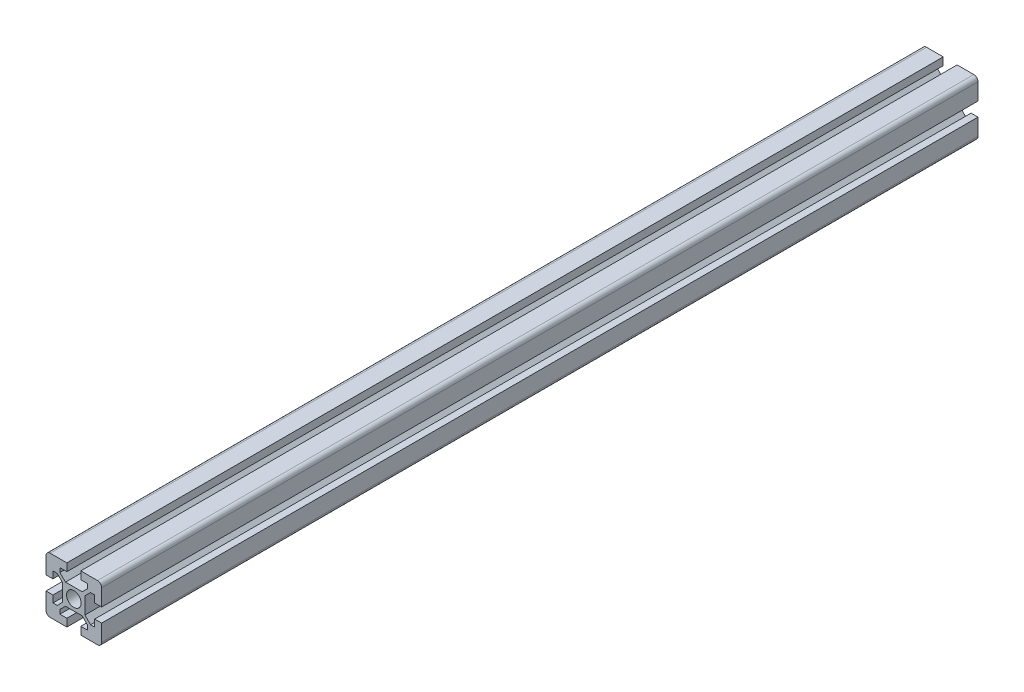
ISO-10303-21;
HEADER;
FILE_DESCRIPTION(('STEP AP214'),'2;1');
FILE_NAME('part.step','',(''),(''),'','','');
FILE_SCHEMA(('AUTOMOTIVE_DESIGN { 1 0 10303 214 1 1 1 1 }'));
ENDSEC;
DATA;
#1=APPLICATION_CONTEXT('core data for automotive mechanical design processes');
#2=APPLICATION_PROTOCOL_DEFINITION('international standard','automotive_design',2000,#1);
#3=PRODUCT_CONTEXT('',#1,'mechanical');
#4=PRODUCT('Part','Part','',(#3));
#5=PRODUCT_RELATED_PRODUCT_CATEGORY('part','',(#4));
#6=PRODUCT_DEFINITION_FORMATION('','',#4);
#7=PRODUCT_DEFINITION_CONTEXT('part definition',#1,'design');
#8=PRODUCT_DEFINITION('design','',#6,#7);
#9=PRODUCT_DEFINITION_SHAPE('','',#8);
#10=(LENGTH_UNIT() NAMED_UNIT(*) SI_UNIT(.MILLI.,.METRE.));
#11=(NAMED_UNIT(*) PLANE_ANGLE_UNIT() SI_UNIT($,.RADIAN.));
#12=(NAMED_UNIT(*) SI_UNIT($,.STERADIAN.) SOLID_ANGLE_UNIT());
#13=UNCERTAINTY_MEASURE_WITH_UNIT(LENGTH_MEASURE(1.E-05),#10,'distance_accuracy_value','');
#14=(GEOMETRIC_REPRESENTATION_CONTEXT(3) GLOBAL_UNCERTAINTY_ASSIGNED_CONTEXT((#13)) GLOBAL_UNIT_ASSIGNED_CONTEXT((#10,
#11,#12)) REPRESENTATION_CONTEXT('',''));
#15=CARTESIAN_POINT('',(0.,0.,0.));
#16=DIRECTION('',(0.,0.,1.));
#17=DIRECTION('',(1.,0.,0.));
#18=AXIS2_PLACEMENT_3D('',#15,#16,#17);
#19=CARTESIAN_POINT('',(20.,0.,630.));
#20=DIRECTION('',(0.,1.,0.));
#21=DIRECTION('',(0.,0.,1.));
#22=AXIS2_PLACEMENT_3D('',#19,#20,#21);
#23=PLANE('',#22);
#24=DIRECTION('',(1.,0.,0.));
#25=VECTOR('',#24,1.);
#26=CARTESIAN_POINT('',(20.,0.,0.));
#27=LINE('',#26,#25);
#28=CARTESIAN_POINT('',(3.00000000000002,0.,0.));
#29=VERTEX_POINT('',#28);
#30=CARTESIAN_POINT('',(15.,0.,0.));
#31=VERTEX_POINT('',#30);
#32=EDGE_CURVE('E371',#29,#31,#27,.T.);
#33=ORIENTED_EDGE('',*,*,#32,.F.);
#34=DIRECTION('',(0.,0.,-1.));
#35=VECTOR('',#34,1.);
#36=CARTESIAN_POINT('',(3.00000000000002,0.,630.));
#37=LINE('',#36,#35);
#38=CARTESIAN_POINT('',(3.00000000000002,0.,630.));
#39=VERTEX_POINT('',#38);
#40=EDGE_CURVE('E11',#39,#29,#37,.T.);
#41=ORIENTED_EDGE('',*,*,#40,.F.);
#42=DIRECTION('',(1.,0.,0.));
#43=VECTOR('',#42,1.);
#44=CARTESIAN_POINT('',(20.,0.,630.));
#45=LINE('',#44,#43);
#46=CARTESIAN_POINT('',(15.,0.,630.));
#47=VERTEX_POINT('',#46);
#48=EDGE_CURVE('E823',#39,#47,#45,.T.);
#49=ORIENTED_EDGE('',*,*,#48,.T.);
#50=DIRECTION('',(0.,0.,-1.));
#51=VECTOR('',#50,1.);
#52=CARTESIAN_POINT('',(15.,0.,630.));
#53=LINE('',#52,#51);
#54=EDGE_CURVE('E50',#47,#31,#53,.T.);
#55=ORIENTED_EDGE('',*,*,#54,.T.);
#56=EDGE_LOOP('',(#33,#41,#49,#55));
#57=FACE_BOUND('',#56,.T.);
#58=ADVANCED_FACE('F33',(#57),#23,.T.);
#59=CARTESIAN_POINT('',(3.,-3.,630.));
#60=DIRECTION('',(0.,0.,-1.));
#61=DIRECTION('',(-1.,0.,0.));
#62=AXIS2_PLACEMENT_3D('',#59,#60,#61);
#63=CYLINDRICAL_SURFACE('',#62,3.);
#64=CARTESIAN_POINT('',(3.,-3.,0.));
#65=DIRECTION('',(0.,0.,1.));
#66=DIRECTION('',(1.,0.,0.));
#67=AXIS2_PLACEMENT_3D('',#64,#65,#66);
#68=CIRCLE('',#67,3.);
#69=CARTESIAN_POINT('',(0.,-3.00000000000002,0.));
#70=VERTEX_POINT('',#69);
#71=EDGE_CURVE('E373',#29,#70,#68,.T.);
#72=ORIENTED_EDGE('',*,*,#71,.T.);
#73=DIRECTION('',(0.,0.,-1.));
#74=VECTOR('',#73,1.);
#75=CARTESIAN_POINT('',(0.,-3.00000000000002,630.));
#76=LINE('',#75,#74);
#77=CARTESIAN_POINT('',(0.,-3.00000000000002,630.));
#78=VERTEX_POINT('',#77);
#79=EDGE_CURVE('E42',#78,#70,#76,.T.);
#80=ORIENTED_EDGE('',*,*,#79,.F.);
#81=CARTESIAN_POINT('',(3.,-3.,630.));
#82=DIRECTION('',(0.,0.,1.));
#83=DIRECTION('',(1.,0.,0.));
#84=AXIS2_PLACEMENT_3D('',#81,#82,#83);
#85=CIRCLE('',#84,3.);
#86=EDGE_CURVE('E825',#39,#78,#85,.T.);
#87=ORIENTED_EDGE('',*,*,#86,.F.);
#88=ORIENTED_EDGE('',*,*,#40,.T.);
#89=EDGE_LOOP('',(#72,#80,#87,#88));
#90=FACE_BOUND('',#89,.T.);
#91=ADVANCED_FACE('F627',(#90),#63,.T.);
#92=CARTESIAN_POINT('',(0.,-64.1414213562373,630.));
#93=DIRECTION('',(1.,0.,0.));
#94=DIRECTION('',(0.,1.,0.));
#95=AXIS2_PLACEMENT_3D('',#92,#93,#94);
#96=PLANE('',#95);
#97=DIRECTION('',(0.,-1.,0.));
#98=VECTOR('',#97,1.);
#99=CARTESIAN_POINT('',(0.,-64.1414213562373,0.));
#100=LINE('',#99,#98);
#101=CARTESIAN_POINT('',(0.,-15.,0.));
#102=VERTEX_POINT('',#101);
#103=EDGE_CURVE('E376',#70,#102,#100,.T.);
#104=ORIENTED_EDGE('',*,*,#103,.T.);
#105=DIRECTION('',(0.,0.,-1.));
#106=VECTOR('',#105,1.);
#107=CARTESIAN_POINT('',(0.,-15.,630.));
#108=LINE('',#107,#106);
#109=CARTESIAN_POINT('',(0.,-15.,630.));
#110=VERTEX_POINT('',#109);
#111=EDGE_CURVE('E615',#110,#102,#108,.T.);
#112=ORIENTED_EDGE('',*,*,#111,.F.);
#113=DIRECTION('',(0.,-1.,0.));
#114=VECTOR('',#113,1.);
#115=CARTESIAN_POINT('',(0.,-64.1414213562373,630.));
#116=LINE('',#115,#114);
#117=EDGE_CURVE('E623',#78,#110,#116,.T.);
#118=ORIENTED_EDGE('',*,*,#117,.F.);
#119=ORIENTED_EDGE('',*,*,#79,.T.);
#120=EDGE_LOOP('',(#104,#112,#118,#119));
#121=FACE_BOUND('',#120,.T.);
#122=ADVANCED_FACE('F620',(#121),#96,.F.);
#123=CARTESIAN_POINT('',(20.,-15.,630.));
#124=DIRECTION('',(0.,1.,0.));
#125=DIRECTION('',(0.,0.,1.));
#126=AXIS2_PLACEMENT_3D('',#123,#124,#125);
#127=PLANE('',#126);
#128=DIRECTION('',(1.,0.,0.));
#129=VECTOR('',#128,1.);
#130=CARTESIAN_POINT('',(20.,-15.,0.));
#131=LINE('',#130,#129);
#132=CARTESIAN_POINT('',(4.99999999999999,-15.,0.));
#133=VERTEX_POINT('',#132);
#134=EDGE_CURVE('E379',#102,#133,#131,.T.);
#135=ORIENTED_EDGE('',*,*,#134,.T.);
#136=DIRECTION('',(0.,0.,-1.));
#137=VECTOR('',#136,1.);
#138=CARTESIAN_POINT('',(4.99999999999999,-15.,630.));
#139=LINE('',#138,#137);
#140=CARTESIAN_POINT('',(4.99999999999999,-15.,630.));
#141=VERTEX_POINT('',#140);
#142=EDGE_CURVE('E612',#141,#133,#139,.T.);
#143=ORIENTED_EDGE('',*,*,#142,.F.);
#144=DIRECTION('',(1.,0.,0.));
#145=VECTOR('',#144,1.);
#146=CARTESIAN_POINT('',(20.,-15.,630.));
#147=LINE('',#146,#145);
#148=EDGE_CURVE('E830',#110,#141,#147,.T.);
#149=ORIENTED_EDGE('',*,*,#148,.F.);
#150=ORIENTED_EDGE('',*,*,#111,.T.);
#151=EDGE_LOOP('',(#135,#143,#149,#150));
#152=FACE_BOUND('',#151,.T.);
#153=ADVANCED_FACE('F638',(#152),#127,.F.);
#154=CARTESIAN_POINT('',(5.,-64.1414213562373,630.));
#155=DIRECTION('',(-1.,0.,0.));
#156=DIRECTION('',(0.,-1.,0.));
#157=AXIS2_PLACEMENT_3D('',#154,#155,#156);
#158=PLANE('',#157);
#159=DIRECTION('',(0.,1.,0.));
#160=VECTOR('',#159,1.);
#161=CARTESIAN_POINT('',(5.,-64.1414213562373,0.));
#162=LINE('',#161,#160);
#163=CARTESIAN_POINT('',(4.99999999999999,-10.,0.));
#164=VERTEX_POINT('',#163);
#165=EDGE_CURVE('E382',#133,#164,#162,.T.);
#166=ORIENTED_EDGE('',*,*,#165,.T.);
#167=DIRECTION('',(0.,0.,-1.));
#168=VECTOR('',#167,1.);
#169=CARTESIAN_POINT('',(4.99999999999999,-10.,630.));
#170=LINE('',#169,#168);
#171=CARTESIAN_POINT('',(4.99999999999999,-10.,630.));
#172=VERTEX_POINT('',#171);
#173=EDGE_CURVE('E609',#172,#164,#170,.T.);
#174=ORIENTED_EDGE('',*,*,#173,.F.);
#175=DIRECTION('',(0.,1.,0.));
#176=VECTOR('',#175,1.);
#177=CARTESIAN_POINT('',(5.,-64.1414213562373,630.));
#178=LINE('',#177,#176);
#179=EDGE_CURVE('E833',#141,#172,#178,.T.);
#180=ORIENTED_EDGE('',*,*,#179,.F.);
#181=ORIENTED_EDGE('',*,*,#142,.T.);
#182=EDGE_LOOP('',(#166,#174,#180,#181));
#183=FACE_BOUND('',#182,.T.);
#184=ADVANCED_FACE('F641',(#183),#158,.F.);
#185=CARTESIAN_POINT('',(20.,-10.,630.));
#186=DIRECTION('',(0.,1.,0.));
#187=DIRECTION('',(0.,0.,1.));
#188=AXIS2_PLACEMENT_3D('',#185,#186,#187);
#189=PLANE('',#188);
#190=DIRECTION('',(1.,0.,0.));
#191=VECTOR('',#190,1.);
#192=CARTESIAN_POINT('',(20.,-10.,0.));
#193=LINE('',#192,#191);
#194=CARTESIAN_POINT('',(7.99999999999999,-10.,0.));
#195=VERTEX_POINT('',#194);
#196=EDGE_CURVE('E385',#164,#195,#193,.T.);
#197=ORIENTED_EDGE('',*,*,#196,.T.);
#198=DIRECTION('',(0.,0.,-1.));
#199=VECTOR('',#198,1.);
#200=CARTESIAN_POINT('',(7.99999999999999,-10.,630.));
#201=LINE('',#200,#199);
#202=CARTESIAN_POINT('',(7.99999999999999,-10.,630.));
#203=VERTEX_POINT('',#202);
#204=EDGE_CURVE('E606',#203,#195,#201,.T.);
#205=ORIENTED_EDGE('',*,*,#204,.F.);
#206=DIRECTION('',(1.,0.,0.));
#207=VECTOR('',#206,1.);
#208=CARTESIAN_POINT('',(20.,-10.,630.));
#209=LINE('',#208,#207);
#210=EDGE_CURVE('E836',#172,#203,#209,.T.);
#211=ORIENTED_EDGE('',*,*,#210,.F.);
#212=ORIENTED_EDGE('',*,*,#173,.T.);
#213=EDGE_LOOP('',(#197,#205,#211,#212));
#214=FACE_BOUND('',#213,.T.);
#215=ADVANCED_FACE('F645',(#214),#189,.F.);
#216=CARTESIAN_POINT('',(41.0707106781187,-43.0707106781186,630.));
#217=DIRECTION('',(0.707106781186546,0.707106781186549,0.));
#218=DIRECTION('',(-0.707106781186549,0.707106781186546,0.));
#219=AXIS2_PLACEMENT_3D('',#216,#217,#218);
#220=PLANE('',#219);
#221=DIRECTION('',(0.707106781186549,-0.707106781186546,0.));
#222=VECTOR('',#221,1.);
#223=CARTESIAN_POINT('',(41.0707106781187,-43.0707106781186,0.));
#224=LINE('',#223,#222);
#225=CARTESIAN_POINT('',(12.,-14.,0.));
#226=VERTEX_POINT('',#225);
#227=EDGE_CURVE('E388',#195,#226,#224,.T.);
#228=ORIENTED_EDGE('',*,*,#227,.T.);
#229=DIRECTION('',(0.,0.,-1.));
#230=VECTOR('',#229,1.);
#231=CARTESIAN_POINT('',(12.,-14.,630.));
#232=LINE('',#231,#230);
#233=CARTESIAN_POINT('',(12.,-14.,630.));
#234=VERTEX_POINT('',#233);
#235=EDGE_CURVE('E603',#234,#226,#232,.T.);
#236=ORIENTED_EDGE('',*,*,#235,.F.);
#237=DIRECTION('',(0.707106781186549,-0.707106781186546,0.));
#238=VECTOR('',#237,1.);
#239=CARTESIAN_POINT('',(41.0707106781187,-43.0707106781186,630.));
#240=LINE('',#239,#238);
#241=EDGE_CURVE('E839',#203,#234,#240,.T.);
#242=ORIENTED_EDGE('',*,*,#241,.F.);
#243=ORIENTED_EDGE('',*,*,#204,.T.);
#244=EDGE_LOOP('',(#228,#236,#242,#243));
#245=FACE_BOUND('',#244,.T.);
#246=ADVANCED_FACE('F649',(#245),#220,.F.);
#247=CARTESIAN_POINT('',(12.,-64.1414213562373,630.));
#248=DIRECTION('',(1.,0.,0.));
#249=DIRECTION('',(0.,1.,0.));
#250=AXIS2_PLACEMENT_3D('',#247,#248,#249);
#251=PLANE('',#250);
#252=DIRECTION('',(0.,-1.,0.));
#253=VECTOR('',#252,1.);
#254=CARTESIAN_POINT('',(12.,-64.1414213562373,0.));
#255=LINE('',#254,#253);
#256=CARTESIAN_POINT('',(12.,-26.,0.));
#257=VERTEX_POINT('',#256);
#258=EDGE_CURVE('E391',#226,#257,#255,.T.);
#259=ORIENTED_EDGE('',*,*,#258,.T.);
#260=DIRECTION('',(0.,0.,-1.));
#261=VECTOR('',#260,1.);
#262=CARTESIAN_POINT('',(12.,-26.,630.));
#263=LINE('',#262,#261);
#264=CARTESIAN_POINT('',(12.,-26.,630.));
#265=VERTEX_POINT('',#264);
#266=EDGE_CURVE('E600',#265,#257,#263,.T.);
#267=ORIENTED_EDGE('',*,*,#266,.F.);
#268=DIRECTION('',(0.,-1.,0.));
#269=VECTOR('',#268,1.);
#270=CARTESIAN_POINT('',(12.,-64.1414213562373,630.));
#271=LINE('',#270,#269);
#272=EDGE_CURVE('E842',#234,#265,#271,.T.);
#273=ORIENTED_EDGE('',*,*,#272,.F.);
#274=ORIENTED_EDGE('',*,*,#235,.T.);
#275=EDGE_LOOP('',(#259,#267,#273,#274));
#276=FACE_BOUND('',#275,.T.);
#277=ADVANCED_FACE('F653',(#276),#251,.F.);
#278=CARTESIAN_POINT('',(-3.07071067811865,-41.0707106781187,630.));
#279=DIRECTION('',(0.707106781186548,-0.707106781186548,0.));
#280=DIRECTION('',(0.707106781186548,0.707106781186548,0.));
#281=AXIS2_PLACEMENT_3D('',#278,#279,#280);
#282=PLANE('',#281);
#283=DIRECTION('',(-0.707106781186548,-0.707106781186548,0.));
#284=VECTOR('',#283,1.);
#285=CARTESIAN_POINT('',(-3.07071067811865,-41.0707106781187,0.));
#286=LINE('',#285,#284);
#287=CARTESIAN_POINT('',(8.00000000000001,-30.,0.));
#288=VERTEX_POINT('',#287);
#289=EDGE_CURVE('E394',#257,#288,#286,.T.);
#290=ORIENTED_EDGE('',*,*,#289,.T.);
#291=DIRECTION('',(0.,0.,-1.));
#292=VECTOR('',#291,1.);
#293=CARTESIAN_POINT('',(8.00000000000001,-30.,630.));
#294=LINE('',#293,#292);
#295=CARTESIAN_POINT('',(8.00000000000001,-30.,630.));
#296=VERTEX_POINT('',#295);
#297=EDGE_CURVE('E597',#296,#288,#294,.T.);
#298=ORIENTED_EDGE('',*,*,#297,.F.);
#299=DIRECTION('',(-0.707106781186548,-0.707106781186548,0.));
#300=VECTOR('',#299,1.);
#301=CARTESIAN_POINT('',(-3.07071067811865,-41.0707106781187,630.));
#302=LINE('',#301,#300);
#303=EDGE_CURVE('E845',#265,#296,#302,.T.);
#304=ORIENTED_EDGE('',*,*,#303,.F.);
#305=ORIENTED_EDGE('',*,*,#266,.T.);
#306=EDGE_LOOP('',(#290,#298,#304,#305));
#307=FACE_BOUND('',#306,.T.);
#308=ADVANCED_FACE('F657',(#307),#282,.F.);
#309=CARTESIAN_POINT('',(20.,-30.,630.));
#310=DIRECTION('',(0.,-1.,0.));
#311=DIRECTION('',(0.,0.,-1.));
#312=AXIS2_PLACEMENT_3D('',#309,#310,#311);
#313=PLANE('',#312);
#314=DIRECTION('',(-1.,0.,0.));
#315=VECTOR('',#314,1.);
#316=CARTESIAN_POINT('',(20.,-30.,0.));
#317=LINE('',#316,#315);
#318=CARTESIAN_POINT('',(5.,-30.,0.));
#319=VERTEX_POINT('',#318);
#320=EDGE_CURVE('E397',#288,#319,#317,.T.);
#321=ORIENTED_EDGE('',*,*,#320,.T.);
#322=DIRECTION('',(0.,0.,-1.));
#323=VECTOR('',#322,1.);
#324=CARTESIAN_POINT('',(5.,-30.,630.));
#325=LINE('',#324,#323);
#326=CARTESIAN_POINT('',(5.,-30.,630.));
#327=VERTEX_POINT('',#326);
#328=EDGE_CURVE('E594',#327,#319,#325,.T.);
#329=ORIENTED_EDGE('',*,*,#328,.F.);
#330=DIRECTION('',(-1.,0.,0.));
#331=VECTOR('',#330,1.);
#332=CARTESIAN_POINT('',(20.,-30.,630.));
#333=LINE('',#332,#331);
#334=EDGE_CURVE('E848',#296,#327,#333,.T.);
#335=ORIENTED_EDGE('',*,*,#334,.F.);
#336=ORIENTED_EDGE('',*,*,#297,.T.);
#337=EDGE_LOOP('',(#321,#329,#335,#336));
#338=FACE_BOUND('',#337,.T.);
#339=ADVANCED_FACE('F661',(#338),#313,.F.);
#340=CARTESIAN_POINT('',(5.,-64.1414213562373,630.));
#341=DIRECTION('',(-1.,0.,0.));
#342=DIRECTION('',(0.,0.,1.));
#343=AXIS2_PLACEMENT_3D('',#340,#341,#342);
#344=PLANE('',#343);
#345=DIRECTION('',(0.,1.,0.));
#346=VECTOR('',#345,1.);
#347=CARTESIAN_POINT('',(5.,-64.1414213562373,0.));
#348=LINE('',#347,#346);
#349=CARTESIAN_POINT('',(5.,-25.,0.));
#350=VERTEX_POINT('',#349);
#351=EDGE_CURVE('E400',#319,#350,#348,.T.);
#352=ORIENTED_EDGE('',*,*,#351,.T.);
#353=DIRECTION('',(0.,0.,-1.));
#354=VECTOR('',#353,1.);
#355=CARTESIAN_POINT('',(5.,-25.,630.));
#356=LINE('',#355,#354);
#357=CARTESIAN_POINT('',(5.,-25.,630.));
#358=VERTEX_POINT('',#357);
#359=EDGE_CURVE('E592',#358,#350,#356,.T.);
#360=ORIENTED_EDGE('',*,*,#359,.F.);
#361=DIRECTION('',(0.,1.,0.));
#362=VECTOR('',#361,1.);
#363=CARTESIAN_POINT('',(5.,-64.1414213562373,630.));
#364=LINE('',#363,#362);
#365=EDGE_CURVE('E851',#327,#358,#364,.T.);
#366=ORIENTED_EDGE('',*,*,#365,.F.);
#367=ORIENTED_EDGE('',*,*,#328,.T.);
#368=EDGE_LOOP('',(#352,#360,#366,#367));
#369=FACE_BOUND('',#368,.T.);
#370=ADVANCED_FACE('F665',(#369),#344,.F.);
#371=CARTESIAN_POINT('',(20.,-25.,630.));
#372=DIRECTION('',(0.,1.,0.));
#373=DIRECTION('',(0.,0.,1.));
#374=AXIS2_PLACEMENT_3D('',#371,#372,#373);
#375=PLANE('',#374);
#376=DIRECTION('',(1.,0.,0.));
#377=VECTOR('',#376,1.);
#378=CARTESIAN_POINT('',(20.,-25.,0.));
#379=LINE('',#378,#377);
#380=CARTESIAN_POINT('',(0.,-25.,0.));
#381=VERTEX_POINT('',#380);
#382=EDGE_CURVE('E403',#381,#350,#379,.T.);
#383=ORIENTED_EDGE('',*,*,#382,.F.);
#384=DIRECTION('',(0.,0.,-1.));
#385=VECTOR('',#384,1.);
#386=CARTESIAN_POINT('',(0.,-25.,630.));
#387=LINE('',#386,#385);
#388=CARTESIAN_POINT('',(0.,-25.,630.));
#389=VERTEX_POINT('',#388);
#390=EDGE_CURVE('E590',#389,#381,#387,.T.);
#391=ORIENTED_EDGE('',*,*,#390,.F.);
#392=DIRECTION('',(1.,0.,0.));
#393=VECTOR('',#392,1.);
#394=CARTESIAN_POINT('',(20.,-25.,630.));
#395=LINE('',#394,#393);
#396=EDGE_CURVE('E853',#389,#358,#395,.T.);
#397=ORIENTED_EDGE('',*,*,#396,.T.);
#398=ORIENTED_EDGE('',*,*,#359,.T.);
#399=EDGE_LOOP('',(#383,#391,#397,#398));
#400=FACE_BOUND('',#399,.T.);
#401=ADVANCED_FACE('F669',(#400),#375,.T.);
#402=CARTESIAN_POINT('',(0.,-64.1414213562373,630.));
#403=DIRECTION('',(1.,0.,0.));
#404=DIRECTION('',(0.,1.,0.));
#405=AXIS2_PLACEMENT_3D('',#402,#403,#404);
#406=PLANE('',#405);
#407=DIRECTION('',(0.,-1.,0.));
#408=VECTOR('',#407,1.);
#409=CARTESIAN_POINT('',(0.,-64.1414213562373,0.));
#410=LINE('',#409,#408);
#411=CARTESIAN_POINT('',(0.,-37.,0.));
#412=VERTEX_POINT('',#411);
#413=EDGE_CURVE('E406',#381,#412,#410,.T.);
#414=ORIENTED_EDGE('',*,*,#413,.T.);
#415=DIRECTION('',(0.,0.,-1.));
#416=VECTOR('',#415,1.);
#417=CARTESIAN_POINT('',(0.,-37.,630.));
#418=LINE('',#417,#416);
#419=CARTESIAN_POINT('',(0.,-37.,630.));
#420=VERTEX_POINT('',#419);
#421=EDGE_CURVE('E587',#420,#412,#418,.T.);
#422=ORIENTED_EDGE('',*,*,#421,.F.);
#423=DIRECTION('',(0.,-1.,0.));
#424=VECTOR('',#423,1.);
#425=CARTESIAN_POINT('',(0.,-64.1414213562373,630.));
#426=LINE('',#425,#424);
#427=EDGE_CURVE('E856',#389,#420,#426,.T.);
#428=ORIENTED_EDGE('',*,*,#427,.F.);
#429=ORIENTED_EDGE('',*,*,#390,.T.);
#430=EDGE_LOOP('',(#414,#422,#428,#429));
#431=FACE_BOUND('',#430,.T.);
#432=ADVANCED_FACE('F673',(#431),#406,.F.);
#433=CARTESIAN_POINT('',(3.,-37.,630.));
#434=DIRECTION('',(0.,0.,-1.));
#435=DIRECTION('',(-1.,0.,0.));
#436=AXIS2_PLACEMENT_3D('',#433,#434,#435);
#437=CYLINDRICAL_SURFACE('',#436,3.);
#438=CARTESIAN_POINT('',(3.,-37.,0.));
#439=DIRECTION('',(0.,0.,1.));
#440=DIRECTION('',(1.,0.,0.));
#441=AXIS2_PLACEMENT_3D('',#438,#439,#440);
#442=CIRCLE('',#441,3.);
#443=CARTESIAN_POINT('',(3.00000000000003,-40.,0.));
#444=VERTEX_POINT('',#443);
#445=EDGE_CURVE('E409',#412,#444,#442,.T.);
#446=ORIENTED_EDGE('',*,*,#445,.T.);
#447=DIRECTION('',(0.,0.,-1.));
#448=VECTOR('',#447,1.);
#449=CARTESIAN_POINT('',(3.00000000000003,-40.,630.));
#450=LINE('',#449,#448);
#451=CARTESIAN_POINT('',(3.00000000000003,-40.,630.));
#452=VERTEX_POINT('',#451);
#453=EDGE_CURVE('E584',#452,#444,#450,.T.);
#454=ORIENTED_EDGE('',*,*,#453,.F.);
#455=CARTESIAN_POINT('',(3.,-37.,630.));
#456=DIRECTION('',(0.,0.,1.));
#457=DIRECTION('',(1.,0.,0.));
#458=AXIS2_PLACEMENT_3D('',#455,#456,#457);
#459=CIRCLE('',#458,3.);
#460=EDGE_CURVE('E859',#420,#452,#459,.T.);
#461=ORIENTED_EDGE('',*,*,#460,.F.);
#462=ORIENTED_EDGE('',*,*,#421,.T.);
#463=EDGE_LOOP('',(#446,#454,#461,#462));
#464=FACE_BOUND('',#463,.T.);
#465=ADVANCED_FACE('F677',(#464),#437,.T.);
#466=CARTESIAN_POINT('',(20.,-40.,630.));
#467=DIRECTION('',(0.,1.,0.));
#468=DIRECTION('',(0.,0.,1.));
#469=AXIS2_PLACEMENT_3D('',#466,#467,#468);
#470=PLANE('',#469);
#471=DIRECTION('',(1.,0.,0.));
#472=VECTOR('',#471,1.);
#473=CARTESIAN_POINT('',(20.,-40.,0.));
#474=LINE('',#473,#472);
#475=CARTESIAN_POINT('',(15.,-40.,0.));
#476=VERTEX_POINT('',#475);
#477=EDGE_CURVE('E412',#444,#476,#474,.T.);
#478=ORIENTED_EDGE('',*,*,#477,.T.);
#479=DIRECTION('',(0.,0.,-1.));
#480=VECTOR('',#479,1.);
#481=CARTESIAN_POINT('',(15.,-40.,630.));
#482=LINE('',#481,#480);
#483=CARTESIAN_POINT('',(15.,-40.,630.));
#484=VERTEX_POINT('',#483);
#485=EDGE_CURVE('E581',#484,#476,#482,.T.);
#486=ORIENTED_EDGE('',*,*,#485,.F.);
#487=DIRECTION('',(1.,0.,0.));
#488=VECTOR('',#487,1.);
#489=CARTESIAN_POINT('',(20.,-40.,630.));
#490=LINE('',#489,#488);
#491=EDGE_CURVE('E862',#452,#484,#490,.T.);
#492=ORIENTED_EDGE('',*,*,#491,.F.);
#493=ORIENTED_EDGE('',*,*,#453,.T.);
#494=EDGE_LOOP('',(#478,#486,#492,#493));
#495=FACE_BOUND('',#494,.T.);
#496=ADVANCED_FACE('F681',(#495),#470,.F.);
#497=CARTESIAN_POINT('',(15.,-64.1414213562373,630.));
#498=DIRECTION('',(-1.,0.,0.));
#499=DIRECTION('',(0.,-1.,0.));
#500=AXIS2_PLACEMENT_3D('',#497,#498,#499);
#501=PLANE('',#500);
#502=DIRECTION('',(0.,1.,0.));
#503=VECTOR('',#502,1.);
#504=CARTESIAN_POINT('',(15.,-64.1414213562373,0.));
#505=LINE('',#504,#503);
#506=CARTESIAN_POINT('',(15.,-34.5,0.));
#507=VERTEX_POINT('',#506);
#508=EDGE_CURVE('E415',#476,#507,#505,.T.);
#509=ORIENTED_EDGE('',*,*,#508,.T.);
#510=DIRECTION('',(0.,0.,-1.));
#511=VECTOR('',#510,1.);
#512=CARTESIAN_POINT('',(15.,-34.5,630.));
#513=LINE('',#512,#511);
#514=CARTESIAN_POINT('',(15.,-34.5,630.));
#515=VERTEX_POINT('',#514);
#516=EDGE_CURVE('E578',#515,#507,#513,.T.);
#517=ORIENTED_EDGE('',*,*,#516,.F.);
#518=DIRECTION('',(0.,1.,0.));
#519=VECTOR('',#518,1.);
#520=CARTESIAN_POINT('',(15.,-64.1414213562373,630.));
#521=LINE('',#520,#519);
#522=EDGE_CURVE('E865',#484,#515,#521,.T.);
#523=ORIENTED_EDGE('',*,*,#522,.F.);
#524=ORIENTED_EDGE('',*,*,#485,.T.);
#525=EDGE_LOOP('',(#509,#517,#523,#524));
#526=FACE_BOUND('',#525,.T.);
#527=ADVANCED_FACE('F685',(#526),#501,.F.);
#528=CARTESIAN_POINT('',(20.,-34.5,630.));
#529=DIRECTION('',(0.,-1.,0.));
#530=DIRECTION('',(0.,0.,-1.));
#531=AXIS2_PLACEMENT_3D('',#528,#529,#530);
#532=PLANE('',#531);
#533=DIRECTION('',(-1.,0.,0.));
#534=VECTOR('',#533,1.);
#535=CARTESIAN_POINT('',(20.,-34.5,0.));
#536=LINE('',#535,#534);
#537=CARTESIAN_POINT('',(10.,-34.5,0.));
#538=VERTEX_POINT('',#537);
#539=EDGE_CURVE('E418',#507,#538,#536,.T.);
#540=ORIENTED_EDGE('',*,*,#539,.T.);
#541=DIRECTION('',(0.,0.,-1.));
#542=VECTOR('',#541,1.);
#543=CARTESIAN_POINT('',(10.,-34.5,630.));
#544=LINE('',#543,#542);
#545=CARTESIAN_POINT('',(10.,-34.5,630.));
#546=VERTEX_POINT('',#545);
#547=EDGE_CURVE('E575',#546,#538,#544,.T.);
#548=ORIENTED_EDGE('',*,*,#547,.F.);
#549=DIRECTION('',(-1.,0.,0.));
#550=VECTOR('',#549,1.);
#551=CARTESIAN_POINT('',(20.,-34.5,630.));
#552=LINE('',#551,#550);
#553=EDGE_CURVE('E868',#515,#546,#552,.T.);
#554=ORIENTED_EDGE('',*,*,#553,.F.);
#555=ORIENTED_EDGE('',*,*,#516,.T.);
#556=EDGE_LOOP('',(#540,#548,#554,#555));
#557=FACE_BOUND('',#556,.T.);
#558=ADVANCED_FACE('F689',(#557),#532,.F.);
#559=CARTESIAN_POINT('',(10.,-64.1414213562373,630.));
#560=DIRECTION('',(-1.,0.,0.));
#561=DIRECTION('',(0.,0.,1.));
#562=AXIS2_PLACEMENT_3D('',#559,#560,#561);
#563=PLANE('',#562);
#564=DIRECTION('',(0.,1.,0.));
#565=VECTOR('',#564,1.);
#566=CARTESIAN_POINT('',(10.,-64.1414213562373,0.));
#567=LINE('',#566,#565);
#568=CARTESIAN_POINT('',(10.,-31.5,0.));
#569=VERTEX_POINT('',#568);
#570=EDGE_CURVE('E421',#538,#569,#567,.T.);
#571=ORIENTED_EDGE('',*,*,#570,.T.);
#572=DIRECTION('',(0.,0.,-1.));
#573=VECTOR('',#572,1.);
#574=CARTESIAN_POINT('',(10.,-31.5,630.));
#575=LINE('',#574,#573);
#576=CARTESIAN_POINT('',(10.,-31.5,630.));
#577=VERTEX_POINT('',#576);
#578=EDGE_CURVE('E572',#577,#569,#575,.T.);
#579=ORIENTED_EDGE('',*,*,#578,.F.);
#580=DIRECTION('',(0.,1.,0.));
#581=VECTOR('',#580,1.);
#582=CARTESIAN_POINT('',(10.,-64.1414213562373,630.));
#583=LINE('',#582,#581);
#584=EDGE_CURVE('E871',#546,#577,#583,.T.);
#585=ORIENTED_EDGE('',*,*,#584,.F.);
#586=ORIENTED_EDGE('',*,*,#547,.T.);
#587=EDGE_LOOP('',(#571,#579,#585,#586));
#588=FACE_BOUND('',#587,.T.);
#589=ADVANCED_FACE('F693',(#588),#563,.F.);
#590=CARTESIAN_POINT('',(-1.32071067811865,-42.8207106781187,630.));
#591=DIRECTION('',(-0.707106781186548,0.707106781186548,0.));
#592=DIRECTION('',(-0.707106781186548,-0.707106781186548,0.));
#593=AXIS2_PLACEMENT_3D('',#590,#591,#592);
#594=PLANE('',#593);
#595=DIRECTION('',(0.707106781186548,0.707106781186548,0.));
#596=VECTOR('',#595,1.);
#597=CARTESIAN_POINT('',(-1.32071067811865,-42.8207106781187,0.));
#598=LINE('',#597,#596);
#599=CARTESIAN_POINT('',(14.,-27.5,0.));
#600=VERTEX_POINT('',#599);
#601=EDGE_CURVE('E424',#569,#600,#598,.T.);
#602=ORIENTED_EDGE('',*,*,#601,.T.);
#603=DIRECTION('',(0.,0.,-1.));
#604=VECTOR('',#603,1.);
#605=CARTESIAN_POINT('',(14.,-27.5,630.));
#606=LINE('',#605,#604);
#607=CARTESIAN_POINT('',(14.,-27.5,630.));
#608=VERTEX_POINT('',#607);
#609=EDGE_CURVE('E569',#608,#600,#606,.T.);
#610=ORIENTED_EDGE('',*,*,#609,.F.);
#611=DIRECTION('',(0.707106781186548,0.707106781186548,0.));
#612=VECTOR('',#611,1.);
#613=CARTESIAN_POINT('',(-1.32071067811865,-42.8207106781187,630.));
#614=LINE('',#613,#612);
#615=EDGE_CURVE('E874',#577,#608,#614,.T.);
#616=ORIENTED_EDGE('',*,*,#615,.F.);
#617=ORIENTED_EDGE('',*,*,#578,.T.);
#618=EDGE_LOOP('',(#602,#610,#616,#617));
#619=FACE_BOUND('',#618,.T.);
#620=ADVANCED_FACE('F697',(#619),#594,.F.);
#621=CARTESIAN_POINT('',(20.,-27.5,630.));
#622=DIRECTION('',(0.,1.,0.));
#623=DIRECTION('',(0.,0.,1.));
#624=AXIS2_PLACEMENT_3D('',#621,#622,#623);
#625=PLANE('',#624);
#626=DIRECTION('',(1.,0.,0.));
#627=VECTOR('',#626,1.);
#628=CARTESIAN_POINT('',(20.,-27.5,0.));
#629=LINE('',#628,#627);
#630=CARTESIAN_POINT('',(26.,-27.5,0.));
#631=VERTEX_POINT('',#630);
#632=EDGE_CURVE('E427',#600,#631,#629,.T.);
#633=ORIENTED_EDGE('',*,*,#632,.T.);
#634=DIRECTION('',(0.,0.,-1.));
#635=VECTOR('',#634,1.);
#636=CARTESIAN_POINT('',(26.,-27.5,630.));
#637=LINE('',#636,#635);
#638=CARTESIAN_POINT('',(26.,-27.5,630.));
#639=VERTEX_POINT('',#638);
#640=EDGE_CURVE('E566',#639,#631,#637,.T.);
#641=ORIENTED_EDGE('',*,*,#640,.F.);
#642=DIRECTION('',(1.,0.,0.));
#643=VECTOR('',#642,1.);
#644=CARTESIAN_POINT('',(20.,-27.5,630.));
#645=LINE('',#644,#643);
#646=EDGE_CURVE('E877',#608,#639,#645,.T.);
#647=ORIENTED_EDGE('',*,*,#646,.F.);
#648=ORIENTED_EDGE('',*,*,#609,.T.);
#649=EDGE_LOOP('',(#633,#641,#647,#648));
#650=FACE_BOUND('',#649,.T.);
#651=ADVANCED_FACE('F701',(#650),#625,.F.);
#652=CARTESIAN_POINT('',(41.3207106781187,-42.8207106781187,630.));
#653=DIRECTION('',(0.707106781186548,0.707106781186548,0.));
#654=DIRECTION('',(-0.707106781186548,0.707106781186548,0.));
#655=AXIS2_PLACEMENT_3D('',#652,#653,#654);
#656=PLANE('',#655);
#657=DIRECTION('',(0.707106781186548,-0.707106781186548,0.));
#658=VECTOR('',#657,1.);
#659=CARTESIAN_POINT('',(41.3207106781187,-42.8207106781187,0.));
#660=LINE('',#659,#658);
#661=CARTESIAN_POINT('',(30.,-31.5,0.));
#662=VERTEX_POINT('',#661);
#663=EDGE_CURVE('E430',#631,#662,#660,.T.);
#664=ORIENTED_EDGE('',*,*,#663,.T.);
#665=DIRECTION('',(0.,0.,-1.));
#666=VECTOR('',#665,1.);
#667=CARTESIAN_POINT('',(30.,-31.5,630.));
#668=LINE('',#667,#666);
#669=CARTESIAN_POINT('',(30.,-31.5,630.));
#670=VERTEX_POINT('',#669);
#671=EDGE_CURVE('E563',#670,#662,#668,.T.);
#672=ORIENTED_EDGE('',*,*,#671,.F.);
#673=DIRECTION('',(0.707106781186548,-0.707106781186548,0.));
#674=VECTOR('',#673,1.);
#675=CARTESIAN_POINT('',(41.3207106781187,-42.8207106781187,630.));
#676=LINE('',#675,#674);
#677=EDGE_CURVE('E880',#639,#670,#676,.T.);
#678=ORIENTED_EDGE('',*,*,#677,.F.);
#679=ORIENTED_EDGE('',*,*,#640,.T.);
#680=EDGE_LOOP('',(#664,#672,#678,#679));
#681=FACE_BOUND('',#680,.T.);
#682=ADVANCED_FACE('F705',(#681),#656,.F.);
#683=CARTESIAN_POINT('',(30.,-64.1414213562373,630.));
#684=DIRECTION('',(1.,0.,0.));
#685=DIRECTION('',(0.,0.,-1.));
#686=AXIS2_PLACEMENT_3D('',#683,#684,#685);
#687=PLANE('',#686);
#688=DIRECTION('',(0.,-1.,0.));
#689=VECTOR('',#688,1.);
#690=CARTESIAN_POINT('',(30.,-64.1414213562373,0.));
#691=LINE('',#690,#689);
#692=CARTESIAN_POINT('',(30.,-34.5,0.));
#693=VERTEX_POINT('',#692);
#694=EDGE_CURVE('E433',#662,#693,#691,.T.);
#695=ORIENTED_EDGE('',*,*,#694,.T.);
#696=DIRECTION('',(0.,0.,-1.));
#697=VECTOR('',#696,1.);
#698=CARTESIAN_POINT('',(30.,-34.5,630.));
#699=LINE('',#698,#697);
#700=CARTESIAN_POINT('',(30.,-34.5,630.));
#701=VERTEX_POINT('',#700);
#702=EDGE_CURVE('E560',#701,#693,#699,.T.);
#703=ORIENTED_EDGE('',*,*,#702,.F.);
#704=DIRECTION('',(0.,-1.,0.));
#705=VECTOR('',#704,1.);
#706=CARTESIAN_POINT('',(30.,-64.1414213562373,630.));
#707=LINE('',#706,#705);
#708=EDGE_CURVE('E883',#670,#701,#707,.T.);
#709=ORIENTED_EDGE('',*,*,#708,.F.);
#710=ORIENTED_EDGE('',*,*,#671,.T.);
#711=EDGE_LOOP('',(#695,#703,#709,#710));
#712=FACE_BOUND('',#711,.T.);
#713=ADVANCED_FACE('F709',(#712),#687,.F.);
#714=CARTESIAN_POINT('',(20.,-34.5,630.));
#715=DIRECTION('',(0.,-1.,0.));
#716=DIRECTION('',(1.,0.,0.));
#717=AXIS2_PLACEMENT_3D('',#714,#715,#716);
#718=PLANE('',#717);
#719=DIRECTION('',(-1.,0.,0.));
#720=VECTOR('',#719,1.);
#721=CARTESIAN_POINT('',(20.,-34.5,0.));
#722=LINE('',#721,#720);
#723=CARTESIAN_POINT('',(25.,-34.5,0.));
#724=VERTEX_POINT('',#723);
#725=EDGE_CURVE('E436',#693,#724,#722,.T.);
#726=ORIENTED_EDGE('',*,*,#725,.T.);
#727=DIRECTION('',(0.,0.,-1.));
#728=VECTOR('',#727,1.);
#729=CARTESIAN_POINT('',(25.,-34.5,630.));
#730=LINE('',#729,#728);
#731=CARTESIAN_POINT('',(25.,-34.5,630.));
#732=VERTEX_POINT('',#731);
#733=EDGE_CURVE('E558',#732,#724,#730,.T.);
#734=ORIENTED_EDGE('',*,*,#733,.F.);
#735=DIRECTION('',(-1.,0.,0.));
#736=VECTOR('',#735,1.);
#737=CARTESIAN_POINT('',(20.,-34.5,630.));
#738=LINE('',#737,#736);
#739=EDGE_CURVE('E886',#701,#732,#738,.T.);
#740=ORIENTED_EDGE('',*,*,#739,.F.);
#741=ORIENTED_EDGE('',*,*,#702,.T.);
#742=EDGE_LOOP('',(#726,#734,#740,#741));
#743=FACE_BOUND('',#742,.T.);
#744=ADVANCED_FACE('F713',(#743),#718,.F.);
#745=CARTESIAN_POINT('',(25.,-64.1414213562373,630.));
#746=DIRECTION('',(-1.,0.,0.));
#747=DIRECTION('',(0.,0.,1.));
#748=AXIS2_PLACEMENT_3D('',#745,#746,#747);
#749=PLANE('',#748);
#750=DIRECTION('',(0.,1.,0.));
#751=VECTOR('',#750,1.);
#752=CARTESIAN_POINT('',(25.,-64.1414213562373,0.));
#753=LINE('',#752,#751);
#754=CARTESIAN_POINT('',(25.,-40.,0.));
#755=VERTEX_POINT('',#754);
#756=EDGE_CURVE('E439',#755,#724,#753,.T.);
#757=ORIENTED_EDGE('',*,*,#756,.F.);
#758=DIRECTION('',(0.,0.,-1.));
#759=VECTOR('',#758,1.);
#760=CARTESIAN_POINT('',(25.,-40.,630.));
#761=LINE('',#760,#759);
#762=CARTESIAN_POINT('',(25.,-40.,630.));
#763=VERTEX_POINT('',#762);
#764=EDGE_CURVE('E556',#763,#755,#761,.T.);
#765=ORIENTED_EDGE('',*,*,#764,.F.);
#766=DIRECTION('',(0.,1.,0.));
#767=VECTOR('',#766,1.);
#768=CARTESIAN_POINT('',(25.,-64.1414213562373,630.));
#769=LINE('',#768,#767);
#770=EDGE_CURVE('E888',#763,#732,#769,.T.);
#771=ORIENTED_EDGE('',*,*,#770,.T.);
#772=ORIENTED_EDGE('',*,*,#733,.T.);
#773=EDGE_LOOP('',(#757,#765,#771,#772));
#774=FACE_BOUND('',#773,.T.);
#775=ADVANCED_FACE('F717',(#774),#749,.T.);
#776=CARTESIAN_POINT('',(20.,-40.,630.));
#777=DIRECTION('',(0.,1.,0.));
#778=DIRECTION('',(0.,0.,1.));
#779=AXIS2_PLACEMENT_3D('',#776,#777,#778);
#780=PLANE('',#779);
#781=DIRECTION('',(1.,0.,0.));
#782=VECTOR('',#781,1.);
#783=CARTESIAN_POINT('',(20.,-40.,0.));
#784=LINE('',#783,#782);
#785=CARTESIAN_POINT('',(37.,-40.,0.));
#786=VERTEX_POINT('',#785);
#787=EDGE_CURVE('E442',#755,#786,#784,.T.);
#788=ORIENTED_EDGE('',*,*,#787,.T.);
#789=DIRECTION('',(0.,0.,-1.));
#790=VECTOR('',#789,1.);
#791=CARTESIAN_POINT('',(37.,-40.,630.));
#792=LINE('',#791,#790);
#793=CARTESIAN_POINT('',(37.,-40.,630.));
#794=VERTEX_POINT('',#793);
#795=EDGE_CURVE('E553',#794,#786,#792,.T.);
#796=ORIENTED_EDGE('',*,*,#795,.F.);
#797=DIRECTION('',(1.,0.,0.));
#798=VECTOR('',#797,1.);
#799=CARTESIAN_POINT('',(20.,-40.,630.));
#800=LINE('',#799,#798);
#801=EDGE_CURVE('E891',#763,#794,#800,.T.);
#802=ORIENTED_EDGE('',*,*,#801,.F.);
#803=ORIENTED_EDGE('',*,*,#764,.T.);
#804=EDGE_LOOP('',(#788,#796,#802,#803));
#805=FACE_BOUND('',#804,.T.);
#806=ADVANCED_FACE('F721',(#805),#780,.F.);
#807=CARTESIAN_POINT('',(37.,-37.,630.));
#808=DIRECTION('',(0.,0.,-1.));
#809=DIRECTION('',(-1.,0.,0.));
#810=AXIS2_PLACEMENT_3D('',#807,#808,#809);
#811=CYLINDRICAL_SURFACE('',#810,3.);
#812=CARTESIAN_POINT('',(37.,-37.,0.));
#813=DIRECTION('',(0.,0.,1.));
#814=DIRECTION('',(1.,0.,0.));
#815=AXIS2_PLACEMENT_3D('',#812,#813,#814);
#816=CIRCLE('',#815,3.);
#817=CARTESIAN_POINT('',(40.,-37.,0.));
#818=VERTEX_POINT('',#817);
#819=EDGE_CURVE('E445',#786,#818,#816,.T.);
#820=ORIENTED_EDGE('',*,*,#819,.T.);
#821=DIRECTION('',(0.,0.,-1.));
#822=VECTOR('',#821,1.);
#823=CARTESIAN_POINT('',(40.,-37.,630.));
#824=LINE('',#823,#822);
#825=CARTESIAN_POINT('',(40.,-37.,630.));
#826=VERTEX_POINT('',#825);
#827=EDGE_CURVE('E551',#826,#818,#824,.T.);
#828=ORIENTED_EDGE('',*,*,#827,.F.);
#829=CARTESIAN_POINT('',(37.,-37.,630.));
#830=DIRECTION('',(0.,0.,1.));
#831=DIRECTION('',(1.,0.,0.));
#832=AXIS2_PLACEMENT_3D('',#829,#830,#831);
#833=CIRCLE('',#832,3.);
#834=EDGE_CURVE('E894',#794,#826,#833,.T.);
#835=ORIENTED_EDGE('',*,*,#834,.F.);
#836=ORIENTED_EDGE('',*,*,#795,.T.);
#837=EDGE_LOOP('',(#820,#828,#835,#836));
#838=FACE_BOUND('',#837,.T.);
#839=ADVANCED_FACE('F725',(#838),#811,.T.);
#840=CARTESIAN_POINT('',(40.,-64.1414213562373,630.));
#841=DIRECTION('',(1.,0.,0.));
#842=DIRECTION('',(0.,1.,0.));
#843=AXIS2_PLACEMENT_3D('',#840,#841,#842);
#844=PLANE('',#843);
#845=DIRECTION('',(0.,-1.,0.));
#846=VECTOR('',#845,1.);
#847=CARTESIAN_POINT('',(40.,-64.1414213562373,0.));
#848=LINE('',#847,#846);
#849=CARTESIAN_POINT('',(40.,-25.,0.));
#850=VERTEX_POINT('',#849);
#851=EDGE_CURVE('E448',#850,#818,#848,.T.);
#852=ORIENTED_EDGE('',*,*,#851,.F.);
#853=DIRECTION('',(0.,0.,-1.));
#854=VECTOR('',#853,1.);
#855=CARTESIAN_POINT('',(40.,-25.,630.));
#856=LINE('',#855,#854);
#857=CARTESIAN_POINT('',(40.,-25.,630.));
#858=VERTEX_POINT('',#857);
#859=EDGE_CURVE('E549',#858,#850,#856,.T.);
#860=ORIENTED_EDGE('',*,*,#859,.F.);
#861=DIRECTION('',(0.,-1.,0.));
#862=VECTOR('',#861,1.);
#863=CARTESIAN_POINT('',(40.,-64.1414213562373,630.));
#864=LINE('',#863,#862);
#865=EDGE_CURVE('E896',#858,#826,#864,.T.);
#866=ORIENTED_EDGE('',*,*,#865,.T.);
#867=ORIENTED_EDGE('',*,*,#827,.T.);
#868=EDGE_LOOP('',(#852,#860,#866,#867));
#869=FACE_BOUND('',#868,.T.);
#870=ADVANCED_FACE('F729',(#869),#844,.T.);
#871=CARTESIAN_POINT('',(20.,-25.,630.));
#872=DIRECTION('',(0.,-1.,0.));
#873=DIRECTION('',(0.,0.,-1.));
#874=AXIS2_PLACEMENT_3D('',#871,#872,#873);
#875=PLANE('',#874);
#876=DIRECTION('',(-1.,0.,0.));
#877=VECTOR('',#876,1.);
#878=CARTESIAN_POINT('',(20.,-25.,0.));
#879=LINE('',#878,#877);
#880=CARTESIAN_POINT('',(35.,-25.,0.));
#881=VERTEX_POINT('',#880);
#882=EDGE_CURVE('E451',#850,#881,#879,.T.);
#883=ORIENTED_EDGE('',*,*,#882,.T.);
#884=DIRECTION('',(0.,0.,-1.));
#885=VECTOR('',#884,1.);
#886=CARTESIAN_POINT('',(35.,-25.,630.));
#887=LINE('',#886,#885);
#888=CARTESIAN_POINT('',(35.,-25.,630.));
#889=VERTEX_POINT('',#888);
#890=EDGE_CURVE('E547',#889,#881,#887,.T.);
#891=ORIENTED_EDGE('',*,*,#890,.F.);
#892=DIRECTION('',(-1.,0.,0.));
#893=VECTOR('',#892,1.);
#894=CARTESIAN_POINT('',(20.,-25.,630.));
#895=LINE('',#894,#893);
#896=EDGE_CURVE('E899',#858,#889,#895,.T.);
#897=ORIENTED_EDGE('',*,*,#896,.F.);
#898=ORIENTED_EDGE('',*,*,#859,.T.);
#899=EDGE_LOOP('',(#883,#891,#897,#898));
#900=FACE_BOUND('',#899,.T.);
#901=ADVANCED_FACE('F733',(#900),#875,.F.);
#902=CARTESIAN_POINT('',(35.,-64.1414213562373,630.));
#903=DIRECTION('',(-1.,0.,0.));
#904=DIRECTION('',(0.,0.,1.));
#905=AXIS2_PLACEMENT_3D('',#902,#903,#904);
#906=PLANE('',#905);
#907=DIRECTION('',(0.,1.,0.));
#908=VECTOR('',#907,1.);
#909=CARTESIAN_POINT('',(35.,-64.1414213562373,0.));
#910=LINE('',#909,#908);
#911=CARTESIAN_POINT('',(35.,-30.,0.));
#912=VERTEX_POINT('',#911);
#913=EDGE_CURVE('E454',#912,#881,#910,.T.);
#914=ORIENTED_EDGE('',*,*,#913,.F.);
#915=DIRECTION('',(0.,0.,-1.));
#916=VECTOR('',#915,1.);
#917=CARTESIAN_POINT('',(35.,-30.,630.));
#918=LINE('',#917,#916);
#919=CARTESIAN_POINT('',(35.,-30.,630.));
#920=VERTEX_POINT('',#919);
#921=EDGE_CURVE('E545',#920,#912,#918,.T.);
#922=ORIENTED_EDGE('',*,*,#921,.F.);
#923=DIRECTION('',(0.,1.,0.));
#924=VECTOR('',#923,1.);
#925=CARTESIAN_POINT('',(35.,-64.1414213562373,630.));
#926=LINE('',#925,#924);
#927=EDGE_CURVE('E901',#920,#889,#926,.T.);
#928=ORIENTED_EDGE('',*,*,#927,.T.);
#929=ORIENTED_EDGE('',*,*,#890,.T.);
#930=EDGE_LOOP('',(#914,#922,#928,#929));
#931=FACE_BOUND('',#930,.T.);
#932=ADVANCED_FACE('F737',(#931),#906,.T.);
#933=CARTESIAN_POINT('',(20.,-30.,630.));
#934=DIRECTION('',(0.,1.,0.));
#935=DIRECTION('',(0.,0.,1.));
#936=AXIS2_PLACEMENT_3D('',#933,#934,#935);
#937=PLANE('',#936);
#938=DIRECTION('',(1.,0.,0.));
#939=VECTOR('',#938,1.);
#940=CARTESIAN_POINT('',(20.,-30.,0.));
#941=LINE('',#940,#939);
#942=CARTESIAN_POINT('',(32.,-30.,0.));
#943=VERTEX_POINT('',#942);
#944=EDGE_CURVE('E457',#943,#912,#941,.T.);
#945=ORIENTED_EDGE('',*,*,#944,.F.);
#946=DIRECTION('',(0.,0.,-1.));
#947=VECTOR('',#946,1.);
#948=CARTESIAN_POINT('',(32.,-30.,630.));
#949=LINE('',#948,#947);
#950=CARTESIAN_POINT('',(32.,-30.,630.));
#951=VERTEX_POINT('',#950);
#952=EDGE_CURVE('E543',#951,#943,#949,.T.);
#953=ORIENTED_EDGE('',*,*,#952,.F.);
#954=DIRECTION('',(1.,0.,0.));
#955=VECTOR('',#954,1.);
#956=CARTESIAN_POINT('',(20.,-30.,630.));
#957=LINE('',#956,#955);
#958=EDGE_CURVE('E904',#951,#920,#957,.T.);
#959=ORIENTED_EDGE('',*,*,#958,.T.);
#960=ORIENTED_EDGE('',*,*,#921,.T.);
#961=EDGE_LOOP('',(#945,#953,#959,#960));
#962=FACE_BOUND('',#961,.T.);
#963=ADVANCED_FACE('F741',(#962),#937,.T.);
#964=CARTESIAN_POINT('',(43.0707106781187,-41.0707106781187,630.));
#965=DIRECTION('',(0.707106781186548,0.707106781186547,0.));
#966=DIRECTION('',(-0.707106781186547,0.707106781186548,0.));
#967=AXIS2_PLACEMENT_3D('',#964,#965,#966);
#968=PLANE('',#967);
#969=DIRECTION('',(0.707106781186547,-0.707106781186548,0.));
#970=VECTOR('',#969,1.);
#971=CARTESIAN_POINT('',(43.0707106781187,-41.0707106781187,0.));
#972=LINE('',#971,#970);
#973=CARTESIAN_POINT('',(28.,-26.,0.));
#974=VERTEX_POINT('',#973);
#975=EDGE_CURVE('E460',#974,#943,#972,.T.);
#976=ORIENTED_EDGE('',*,*,#975,.F.);
#977=DIRECTION('',(0.,0.,-1.));
#978=VECTOR('',#977,1.);
#979=CARTESIAN_POINT('',(28.,-26.,630.));
#980=LINE('',#979,#978);
#981=CARTESIAN_POINT('',(28.,-26.,630.));
#982=VERTEX_POINT('',#981);
#983=EDGE_CURVE('E541',#982,#974,#980,.T.);
#984=ORIENTED_EDGE('',*,*,#983,.F.);
#985=DIRECTION('',(0.707106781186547,-0.707106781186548,0.));
#986=VECTOR('',#985,1.);
#987=CARTESIAN_POINT('',(43.0707106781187,-41.0707106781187,630.));
#988=LINE('',#987,#986);
#989=EDGE_CURVE('E907',#982,#951,#988,.T.);
#990=ORIENTED_EDGE('',*,*,#989,.T.);
#991=ORIENTED_EDGE('',*,*,#952,.T.);
#992=EDGE_LOOP('',(#976,#984,#990,#991));
#993=FACE_BOUND('',#992,.T.);
#994=ADVANCED_FACE('F745',(#993),#968,.T.);
#995=CARTESIAN_POINT('',(28.,-64.1414213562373,630.));
#996=DIRECTION('',(1.,0.,0.));
#997=DIRECTION('',(0.,1.,0.));
#998=AXIS2_PLACEMENT_3D('',#995,#996,#997);
#999=PLANE('',#998);
#1000=DIRECTION('',(0.,-1.,0.));
#1001=VECTOR('',#1000,1.);
#1002=CARTESIAN_POINT('',(28.,-64.1414213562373,0.));
#1003=LINE('',#1002,#1001);
#1004=CARTESIAN_POINT('',(28.,-14.,0.));
#1005=VERTEX_POINT('',#1004);
#1006=EDGE_CURVE('E463',#1005,#974,#1003,.T.);
#1007=ORIENTED_EDGE('',*,*,#1006,.F.);
#1008=DIRECTION('',(0.,0.,-1.));
#1009=VECTOR('',#1008,1.);
#1010=CARTESIAN_POINT('',(28.,-14.,630.));
#1011=LINE('',#1010,#1009);
#1012=CARTESIAN_POINT('',(28.,-14.,630.));
#1013=VERTEX_POINT('',#1012);
#1014=EDGE_CURVE('E539',#1013,#1005,#1011,.T.);
#1015=ORIENTED_EDGE('',*,*,#1014,.F.);
#1016=DIRECTION('',(0.,-1.,0.));
#1017=VECTOR('',#1016,1.);
#1018=CARTESIAN_POINT('',(28.,-64.1414213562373,630.));
#1019=LINE('',#1018,#1017);
#1020=EDGE_CURVE('E910',#1013,#982,#1019,.T.);
#1021=ORIENTED_EDGE('',*,*,#1020,.T.);
#1022=ORIENTED_EDGE('',*,*,#983,.T.);
#1023=EDGE_LOOP('',(#1007,#1015,#1021,#1022));
#1024=FACE_BOUND('',#1023,.T.);
#1025=ADVANCED_FACE('F749',(#1024),#999,.T.);
#1026=CARTESIAN_POINT('',(-1.07071067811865,-43.0707106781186,630.));
#1027=DIRECTION('',(0.707106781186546,-0.707106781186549,0.));
#1028=DIRECTION('',(0.707106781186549,0.707106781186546,0.));
#1029=AXIS2_PLACEMENT_3D('',#1026,#1027,#1028);
#1030=PLANE('',#1029);
#1031=DIRECTION('',(-0.707106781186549,-0.707106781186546,0.));
#1032=VECTOR('',#1031,1.);
#1033=CARTESIAN_POINT('',(-1.07071067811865,-43.0707106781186,0.));
#1034=LINE('',#1033,#1032);
#1035=CARTESIAN_POINT('',(32.,-10.,0.));
#1036=VERTEX_POINT('',#1035);
#1037=EDGE_CURVE('E466',#1036,#1005,#1034,.T.);
#1038=ORIENTED_EDGE('',*,*,#1037,.F.);
#1039=DIRECTION('',(0.,0.,-1.));
#1040=VECTOR('',#1039,1.);
#1041=CARTESIAN_POINT('',(32.,-10.,630.));
#1042=LINE('',#1041,#1040);
#1043=CARTESIAN_POINT('',(32.,-10.,630.));
#1044=VERTEX_POINT('',#1043);
#1045=EDGE_CURVE('E537',#1044,#1036,#1042,.T.);
#1046=ORIENTED_EDGE('',*,*,#1045,.F.);
#1047=DIRECTION('',(-0.707106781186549,-0.707106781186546,0.));
#1048=VECTOR('',#1047,1.);
#1049=CARTESIAN_POINT('',(-1.07071067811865,-43.0707106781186,630.));
#1050=LINE('',#1049,#1048);
#1051=EDGE_CURVE('E913',#1044,#1013,#1050,.T.);
#1052=ORIENTED_EDGE('',*,*,#1051,.T.);
#1053=ORIENTED_EDGE('',*,*,#1014,.T.);
#1054=EDGE_LOOP('',(#1038,#1046,#1052,#1053));
#1055=FACE_BOUND('',#1054,.T.);
#1056=ADVANCED_FACE('F753',(#1055),#1030,.T.);
#1057=CARTESIAN_POINT('',(20.,-10.,630.));
#1058=DIRECTION('',(0.,-1.,0.));
#1059=DIRECTION('',(0.,0.,-1.));
#1060=AXIS2_PLACEMENT_3D('',#1057,#1058,#1059);
#1061=PLANE('',#1060);
#1062=DIRECTION('',(-1.,0.,0.));
#1063=VECTOR('',#1062,1.);
#1064=CARTESIAN_POINT('',(20.,-10.,0.));
#1065=LINE('',#1064,#1063);
#1066=CARTESIAN_POINT('',(35.,-10.,0.));
#1067=VERTEX_POINT('',#1066);
#1068=EDGE_CURVE('E469',#1067,#1036,#1065,.T.);
#1069=ORIENTED_EDGE('',*,*,#1068,.F.);
#1070=DIRECTION('',(0.,0.,-1.));
#1071=VECTOR('',#1070,1.);
#1072=CARTESIAN_POINT('',(35.,-10.,630.));
#1073=LINE('',#1072,#1071);
#1074=CARTESIAN_POINT('',(35.,-10.,630.));
#1075=VERTEX_POINT('',#1074);
#1076=EDGE_CURVE('E535',#1075,#1067,#1073,.T.);
#1077=ORIENTED_EDGE('',*,*,#1076,.F.);
#1078=DIRECTION('',(-1.,0.,0.));
#1079=VECTOR('',#1078,1.);
#1080=CARTESIAN_POINT('',(20.,-10.,630.));
#1081=LINE('',#1080,#1079);
#1082=EDGE_CURVE('E916',#1075,#1044,#1081,.T.);
#1083=ORIENTED_EDGE('',*,*,#1082,.T.);
#1084=ORIENTED_EDGE('',*,*,#1045,.T.);
#1085=EDGE_LOOP('',(#1069,#1077,#1083,#1084));
#1086=FACE_BOUND('',#1085,.T.);
#1087=ADVANCED_FACE('F757',(#1086),#1061,.T.);
#1088=CARTESIAN_POINT('',(35.0000000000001,-64.1414213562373,630.));
#1089=DIRECTION('',(-1.,0.,0.));
#1090=DIRECTION('',(0.,-1.,0.));
#1091=AXIS2_PLACEMENT_3D('',#1088,#1089,#1090);
#1092=PLANE('',#1091);
#1093=DIRECTION('',(0.,1.,0.));
#1094=VECTOR('',#1093,1.);
#1095=CARTESIAN_POINT('',(35.0000000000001,-64.1414213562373,0.));
#1096=LINE('',#1095,#1094);
#1097=CARTESIAN_POINT('',(35.,-15.,0.));
#1098=VERTEX_POINT('',#1097);
#1099=EDGE_CURVE('E472',#1098,#1067,#1096,.T.);
#1100=ORIENTED_EDGE('',*,*,#1099,.F.);
#1101=DIRECTION('',(0.,0.,-1.));
#1102=VECTOR('',#1101,1.);
#1103=CARTESIAN_POINT('',(35.,-15.,630.));
#1104=LINE('',#1103,#1102);
#1105=CARTESIAN_POINT('',(35.,-15.,630.));
#1106=VERTEX_POINT('',#1105);
#1107=EDGE_CURVE('E533',#1106,#1098,#1104,.T.);
#1108=ORIENTED_EDGE('',*,*,#1107,.F.);
#1109=DIRECTION('',(0.,1.,0.));
#1110=VECTOR('',#1109,1.);
#1111=CARTESIAN_POINT('',(35.0000000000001,-64.1414213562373,630.));
#1112=LINE('',#1111,#1110);
#1113=EDGE_CURVE('E919',#1106,#1075,#1112,.T.);
#1114=ORIENTED_EDGE('',*,*,#1113,.T.);
#1115=ORIENTED_EDGE('',*,*,#1076,.T.);
#1116=EDGE_LOOP('',(#1100,#1108,#1114,#1115));
#1117=FACE_BOUND('',#1116,.T.);
#1118=ADVANCED_FACE('F761',(#1117),#1092,.T.);
#1119=CARTESIAN_POINT('',(20.,-15.,630.));
#1120=DIRECTION('',(0.,-1.,0.));
#1121=DIRECTION('',(0.,0.,-1.));
#1122=AXIS2_PLACEMENT_3D('',#1119,#1120,#1121);
#1123=PLANE('',#1122);
#1124=DIRECTION('',(-1.,0.,0.));
#1125=VECTOR('',#1124,1.);
#1126=CARTESIAN_POINT('',(20.,-15.,0.));
#1127=LINE('',#1126,#1125);
#1128=CARTESIAN_POINT('',(40.,-15.,0.));
#1129=VERTEX_POINT('',#1128);
#1130=EDGE_CURVE('E475',#1129,#1098,#1127,.T.);
#1131=ORIENTED_EDGE('',*,*,#1130,.F.);
#1132=DIRECTION('',(0.,0.,-1.));
#1133=VECTOR('',#1132,1.);
#1134=CARTESIAN_POINT('',(40.,-15.,630.));
#1135=LINE('',#1134,#1133);
#1136=CARTESIAN_POINT('',(40.,-15.,630.));
#1137=VERTEX_POINT('',#1136);
#1138=EDGE_CURVE('E531',#1137,#1129,#1135,.T.);
#1139=ORIENTED_EDGE('',*,*,#1138,.F.);
#1140=DIRECTION('',(-1.,0.,0.));
#1141=VECTOR('',#1140,1.);
#1142=CARTESIAN_POINT('',(20.,-15.,630.));
#1143=LINE('',#1142,#1141);
#1144=EDGE_CURVE('E922',#1137,#1106,#1143,.T.);
#1145=ORIENTED_EDGE('',*,*,#1144,.T.);
#1146=ORIENTED_EDGE('',*,*,#1107,.T.);
#1147=EDGE_LOOP('',(#1131,#1139,#1145,#1146));
#1148=FACE_BOUND('',#1147,.T.);
#1149=ADVANCED_FACE('F765',(#1148),#1123,.T.);
#1150=CARTESIAN_POINT('',(40.,-64.1414213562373,630.));
#1151=DIRECTION('',(1.,0.,0.));
#1152=DIRECTION('',(0.,0.,-1.));
#1153=AXIS2_PLACEMENT_3D('',#1150,#1151,#1152);
#1154=PLANE('',#1153);
#1155=DIRECTION('',(0.,-1.,0.));
#1156=VECTOR('',#1155,1.);
#1157=CARTESIAN_POINT('',(40.,-64.1414213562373,0.));
#1158=LINE('',#1157,#1156);
#1159=CARTESIAN_POINT('',(40.,-3.00000000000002,0.));
#1160=VERTEX_POINT('',#1159);
#1161=EDGE_CURVE('E478',#1160,#1129,#1158,.T.);
#1162=ORIENTED_EDGE('',*,*,#1161,.F.);
#1163=DIRECTION('',(0.,0.,-1.));
#1164=VECTOR('',#1163,1.);
#1165=CARTESIAN_POINT('',(40.,-3.00000000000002,630.));
#1166=LINE('',#1165,#1164);
#1167=CARTESIAN_POINT('',(40.,-3.00000000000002,630.));
#1168=VERTEX_POINT('',#1167);
#1169=EDGE_CURVE('E529',#1168,#1160,#1166,.T.);
#1170=ORIENTED_EDGE('',*,*,#1169,.F.);
#1171=DIRECTION('',(0.,-1.,0.));
#1172=VECTOR('',#1171,1.);
#1173=CARTESIAN_POINT('',(40.,-64.1414213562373,630.));
#1174=LINE('',#1173,#1172);
#1175=EDGE_CURVE('E925',#1168,#1137,#1174,.T.);
#1176=ORIENTED_EDGE('',*,*,#1175,.T.);
#1177=ORIENTED_EDGE('',*,*,#1138,.T.);
#1178=EDGE_LOOP('',(#1162,#1170,#1176,#1177));
#1179=FACE_BOUND('',#1178,.T.);
#1180=ADVANCED_FACE('F769',(#1179),#1154,.T.);
#1181=CARTESIAN_POINT('',(37.,-3.,630.));
#1182=DIRECTION('',(0.,0.,-1.));
#1183=DIRECTION('',(-1.,0.,0.));
#1184=AXIS2_PLACEMENT_3D('',#1181,#1182,#1183);
#1185=CYLINDRICAL_SURFACE('',#1184,3.);
#1186=CARTESIAN_POINT('',(37.,-3.,0.));
#1187=DIRECTION('',(0.,0.,1.));
#1188=DIRECTION('',(1.,0.,0.));
#1189=AXIS2_PLACEMENT_3D('',#1186,#1187,#1188);
#1190=CIRCLE('',#1189,3.);
#1191=CARTESIAN_POINT('',(37.,0.,0.));
#1192=VERTEX_POINT('',#1191);
#1193=EDGE_CURVE('E481',#1192,#1160,#1190,.F.);
#1194=ORIENTED_EDGE('',*,*,#1193,.F.);
#1195=DIRECTION('',(0.,0.,-1.));
#1196=VECTOR('',#1195,1.);
#1197=CARTESIAN_POINT('',(37.,0.,630.));
#1198=LINE('',#1197,#1196);
#1199=CARTESIAN_POINT('',(37.,0.,630.));
#1200=VERTEX_POINT('',#1199);
#1201=EDGE_CURVE('E527',#1200,#1192,#1198,.T.);
#1202=ORIENTED_EDGE('',*,*,#1201,.F.);
#1203=CARTESIAN_POINT('',(37.,-3.,630.));
#1204=DIRECTION('',(0.,0.,1.));
#1205=DIRECTION('',(1.,0.,0.));
#1206=AXIS2_PLACEMENT_3D('',#1203,#1204,#1205);
#1207=CIRCLE('',#1206,3.);
#1208=EDGE_CURVE('E928',#1200,#1168,#1207,.F.);
#1209=ORIENTED_EDGE('',*,*,#1208,.T.);
#1210=ORIENTED_EDGE('',*,*,#1169,.T.);
#1211=EDGE_LOOP('',(#1194,#1202,#1209,#1210));
#1212=FACE_BOUND('',#1211,.T.);
#1213=ADVANCED_FACE('F773',(#1212),#1185,.T.);
#1214=CARTESIAN_POINT('',(20.,0.,630.));
#1215=DIRECTION('',(0.,1.,0.));
#1216=DIRECTION('',(0.,0.,1.));
#1217=AXIS2_PLACEMENT_3D('',#1214,#1215,#1216);
#1218=PLANE('',#1217);
#1219=DIRECTION('',(1.,0.,0.));
#1220=VECTOR('',#1219,1.);
#1221=CARTESIAN_POINT('',(20.,0.,0.));
#1222=LINE('',#1221,#1220);
#1223=CARTESIAN_POINT('',(25.,0.,0.));
#1224=VERTEX_POINT('',#1223);
#1225=EDGE_CURVE('E484',#1224,#1192,#1222,.T.);
#1226=ORIENTED_EDGE('',*,*,#1225,.F.);
#1227=DIRECTION('',(0.,0.,-1.));
#1228=VECTOR('',#1227,1.);
#1229=CARTESIAN_POINT('',(25.,0.,630.));
#1230=LINE('',#1229,#1228);
#1231=CARTESIAN_POINT('',(25.,0.,630.));
#1232=VERTEX_POINT('',#1231);
#1233=EDGE_CURVE('E525',#1232,#1224,#1230,.T.);
#1234=ORIENTED_EDGE('',*,*,#1233,.F.);
#1235=DIRECTION('',(1.,0.,0.));
#1236=VECTOR('',#1235,1.);
#1237=CARTESIAN_POINT('',(20.,0.,630.));
#1238=LINE('',#1237,#1236);
#1239=EDGE_CURVE('E931',#1232,#1200,#1238,.T.);
#1240=ORIENTED_EDGE('',*,*,#1239,.T.);
#1241=ORIENTED_EDGE('',*,*,#1201,.T.);
#1242=EDGE_LOOP('',(#1226,#1234,#1240,#1241));
#1243=FACE_BOUND('',#1242,.T.);
#1244=ADVANCED_FACE('F777',(#1243),#1218,.T.);
#1245=CARTESIAN_POINT('',(25.,-64.1414213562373,630.));
#1246=DIRECTION('',(1.,0.,0.));
#1247=DIRECTION('',(0.,0.,-1.));
#1248=AXIS2_PLACEMENT_3D('',#1245,#1246,#1247);
#1249=PLANE('',#1248);
#1250=DIRECTION('',(0.,-1.,0.));
#1251=VECTOR('',#1250,1.);
#1252=CARTESIAN_POINT('',(25.,-64.1414213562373,0.));
#1253=LINE('',#1252,#1251);
#1254=CARTESIAN_POINT('',(25.,-5.5,0.));
#1255=VERTEX_POINT('',#1254);
#1256=EDGE_CURVE('E487',#1224,#1255,#1253,.T.);
#1257=ORIENTED_EDGE('',*,*,#1256,.T.);
#1258=DIRECTION('',(0.,0.,-1.));
#1259=VECTOR('',#1258,1.);
#1260=CARTESIAN_POINT('',(25.,-5.5,630.));
#1261=LINE('',#1260,#1259);
#1262=CARTESIAN_POINT('',(25.,-5.5,630.));
#1263=VERTEX_POINT('',#1262);
#1264=EDGE_CURVE('E523',#1263,#1255,#1261,.T.);
#1265=ORIENTED_EDGE('',*,*,#1264,.F.);
#1266=DIRECTION('',(0.,-1.,0.));
#1267=VECTOR('',#1266,1.);
#1268=CARTESIAN_POINT('',(25.,-64.1414213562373,630.));
#1269=LINE('',#1268,#1267);
#1270=EDGE_CURVE('E934',#1232,#1263,#1269,.T.);
#1271=ORIENTED_EDGE('',*,*,#1270,.F.);
#1272=ORIENTED_EDGE('',*,*,#1233,.T.);
#1273=EDGE_LOOP('',(#1257,#1265,#1271,#1272));
#1274=FACE_BOUND('',#1273,.T.);
#1275=ADVANCED_FACE('F781',(#1274),#1249,.F.);
#1276=CARTESIAN_POINT('',(20.,-5.5,630.));
#1277=DIRECTION('',(0.,-1.,0.));
#1278=DIRECTION('',(1.,0.,0.));
#1279=AXIS2_PLACEMENT_3D('',#1276,#1277,#1278);
#1280=PLANE('',#1279);
#1281=DIRECTION('',(-1.,0.,0.));
#1282=VECTOR('',#1281,1.);
#1283=CARTESIAN_POINT('',(20.,-5.5,0.));
#1284=LINE('',#1283,#1282);
#1285=CARTESIAN_POINT('',(30.,-5.50000000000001,0.));
#1286=VERTEX_POINT('',#1285);
#1287=EDGE_CURVE('E490',#1286,#1255,#1284,.T.);
#1288=ORIENTED_EDGE('',*,*,#1287,.F.);
#1289=DIRECTION('',(0.,0.,-1.));
#1290=VECTOR('',#1289,1.);
#1291=CARTESIAN_POINT('',(30.,-5.50000000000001,630.));
#1292=LINE('',#1291,#1290);
#1293=CARTESIAN_POINT('',(30.,-5.50000000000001,630.));
#1294=VERTEX_POINT('',#1293);
#1295=EDGE_CURVE('E521',#1294,#1286,#1292,.T.);
#1296=ORIENTED_EDGE('',*,*,#1295,.F.);
#1297=DIRECTION('',(-1.,0.,0.));
#1298=VECTOR('',#1297,1.);
#1299=CARTESIAN_POINT('',(20.,-5.5,630.));
#1300=LINE('',#1299,#1298);
#1301=EDGE_CURVE('E936',#1294,#1263,#1300,.T.);
#1302=ORIENTED_EDGE('',*,*,#1301,.T.);
#1303=ORIENTED_EDGE('',*,*,#1264,.T.);
#1304=EDGE_LOOP('',(#1288,#1296,#1302,#1303));
#1305=FACE_BOUND('',#1304,.T.);
#1306=ADVANCED_FACE('F785',(#1305),#1280,.T.);
#1307=CARTESIAN_POINT('',(30.,-64.1414213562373,630.));
#1308=DIRECTION('',(-1.,0.,0.));
#1309=DIRECTION('',(0.,0.,1.));
#1310=AXIS2_PLACEMENT_3D('',#1307,#1308,#1309);
#1311=PLANE('',#1310);
#1312=DIRECTION('',(0.,1.,0.));
#1313=VECTOR('',#1312,1.);
#1314=CARTESIAN_POINT('',(30.,-64.1414213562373,0.));
#1315=LINE('',#1314,#1313);
#1316=CARTESIAN_POINT('',(30.,-8.5,0.));
#1317=VERTEX_POINT('',#1316);
#1318=EDGE_CURVE('E493',#1317,#1286,#1315,.T.);
#1319=ORIENTED_EDGE('',*,*,#1318,.F.);
#1320=DIRECTION('',(0.,0.,-1.));
#1321=VECTOR('',#1320,1.);
#1322=CARTESIAN_POINT('',(30.,-8.5,630.));
#1323=LINE('',#1322,#1321);
#1324=CARTESIAN_POINT('',(30.,-8.5,630.));
#1325=VERTEX_POINT('',#1324);
#1326=EDGE_CURVE('E519',#1325,#1317,#1323,.T.);
#1327=ORIENTED_EDGE('',*,*,#1326,.F.);
#1328=DIRECTION('',(0.,1.,0.));
#1329=VECTOR('',#1328,1.);
#1330=CARTESIAN_POINT('',(30.,-64.1414213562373,630.));
#1331=LINE('',#1330,#1329);
#1332=EDGE_CURVE('E939',#1325,#1294,#1331,.T.);
#1333=ORIENTED_EDGE('',*,*,#1332,.T.);
#1334=ORIENTED_EDGE('',*,*,#1295,.T.);
#1335=EDGE_LOOP('',(#1319,#1327,#1333,#1334));
#1336=FACE_BOUND('',#1335,.T.);
#1337=ADVANCED_FACE('F789',(#1336),#1311,.T.);
#1338=CARTESIAN_POINT('',(-2.82071067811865,-41.3207106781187,630.));
#1339=DIRECTION('',(-0.707106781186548,0.707106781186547,0.));
#1340=DIRECTION('',(-0.707106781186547,-0.707106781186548,0.));
#1341=AXIS2_PLACEMENT_3D('',#1338,#1339,#1340);
#1342=PLANE('',#1341);
#1343=DIRECTION('',(0.707106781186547,0.707106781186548,0.));
#1344=VECTOR('',#1343,1.);
#1345=CARTESIAN_POINT('',(-2.82071067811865,-41.3207106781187,0.));
#1346=LINE('',#1345,#1344);
#1347=CARTESIAN_POINT('',(26.,-12.5,0.));
#1348=VERTEX_POINT('',#1347);
#1349=EDGE_CURVE('E496',#1348,#1317,#1346,.T.);
#1350=ORIENTED_EDGE('',*,*,#1349,.F.);
#1351=DIRECTION('',(0.,0.,-1.));
#1352=VECTOR('',#1351,1.);
#1353=CARTESIAN_POINT('',(26.,-12.5,630.));
#1354=LINE('',#1353,#1352);
#1355=CARTESIAN_POINT('',(26.,-12.5,630.));
#1356=VERTEX_POINT('',#1355);
#1357=EDGE_CURVE('E517',#1356,#1348,#1354,.T.);
#1358=ORIENTED_EDGE('',*,*,#1357,.F.);
#1359=DIRECTION('',(0.707106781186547,0.707106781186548,0.));
#1360=VECTOR('',#1359,1.);
#1361=CARTESIAN_POINT('',(-2.82071067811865,-41.3207106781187,630.));
#1362=LINE('',#1361,#1360);
#1363=EDGE_CURVE('E942',#1356,#1325,#1362,.T.);
#1364=ORIENTED_EDGE('',*,*,#1363,.T.);
#1365=ORIENTED_EDGE('',*,*,#1326,.T.);
#1366=EDGE_LOOP('',(#1350,#1358,#1364,#1365));
#1367=FACE_BOUND('',#1366,.T.);
#1368=ADVANCED_FACE('F793',(#1367),#1342,.T.);
#1369=CARTESIAN_POINT('',(20.,-12.5,630.));
#1370=DIRECTION('',(0.,1.,0.));
#1371=DIRECTION('',(0.,0.,1.));
#1372=AXIS2_PLACEMENT_3D('',#1369,#1370,#1371);
#1373=PLANE('',#1372);
#1374=DIRECTION('',(1.,0.,0.));
#1375=VECTOR('',#1374,1.);
#1376=CARTESIAN_POINT('',(20.,-12.5,0.));
#1377=LINE('',#1376,#1375);
#1378=CARTESIAN_POINT('',(14.,-12.5,0.));
#1379=VERTEX_POINT('',#1378);
#1380=EDGE_CURVE('E499',#1379,#1348,#1377,.T.);
#1381=ORIENTED_EDGE('',*,*,#1380,.F.);
#1382=DIRECTION('',(0.,0.,-1.));
#1383=VECTOR('',#1382,1.);
#1384=CARTESIAN_POINT('',(14.,-12.5,630.));
#1385=LINE('',#1384,#1383);
#1386=CARTESIAN_POINT('',(14.,-12.5,630.));
#1387=VERTEX_POINT('',#1386);
#1388=EDGE_CURVE('E515',#1387,#1379,#1385,.T.);
#1389=ORIENTED_EDGE('',*,*,#1388,.F.);
#1390=DIRECTION('',(1.,0.,0.));
#1391=VECTOR('',#1390,1.);
#1392=CARTESIAN_POINT('',(20.,-12.5,630.));
#1393=LINE('',#1392,#1391);
#1394=EDGE_CURVE('E945',#1387,#1356,#1393,.T.);
#1395=ORIENTED_EDGE('',*,*,#1394,.T.);
#1396=ORIENTED_EDGE('',*,*,#1357,.T.);
#1397=EDGE_LOOP('',(#1381,#1389,#1395,#1396));
#1398=FACE_BOUND('',#1397,.T.);
#1399=ADVANCED_FACE('F797',(#1398),#1373,.T.);
#1400=CARTESIAN_POINT('',(42.8207106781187,-41.3207106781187,630.));
#1401=DIRECTION('',(0.707106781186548,0.707106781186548,0.));
#1402=DIRECTION('',(-0.707106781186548,0.707106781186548,0.));
#1403=AXIS2_PLACEMENT_3D('',#1400,#1401,#1402);
#1404=PLANE('',#1403);
#1405=DIRECTION('',(0.707106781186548,-0.707106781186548,0.));
#1406=VECTOR('',#1405,1.);
#1407=CARTESIAN_POINT('',(42.8207106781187,-41.3207106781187,0.));
#1408=LINE('',#1407,#1406);
#1409=CARTESIAN_POINT('',(10.,-8.5,0.));
#1410=VERTEX_POINT('',#1409);
#1411=EDGE_CURVE('E502',#1410,#1379,#1408,.T.);
#1412=ORIENTED_EDGE('',*,*,#1411,.F.);
#1413=DIRECTION('',(0.,0.,-1.));
#1414=VECTOR('',#1413,1.);
#1415=CARTESIAN_POINT('',(10.,-8.5,630.));
#1416=LINE('',#1415,#1414);
#1417=CARTESIAN_POINT('',(10.,-8.5,630.));
#1418=VERTEX_POINT('',#1417);
#1419=EDGE_CURVE('E349',#1418,#1410,#1416,.T.);
#1420=ORIENTED_EDGE('',*,*,#1419,.F.);
#1421=DIRECTION('',(0.707106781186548,-0.707106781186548,0.));
#1422=VECTOR('',#1421,1.);
#1423=CARTESIAN_POINT('',(42.8207106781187,-41.3207106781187,630.));
#1424=LINE('',#1423,#1422);
#1425=EDGE_CURVE('E360',#1418,#1387,#1424,.T.);
#1426=ORIENTED_EDGE('',*,*,#1425,.T.);
#1427=ORIENTED_EDGE('',*,*,#1388,.T.);
#1428=EDGE_LOOP('',(#1412,#1420,#1426,#1427));
#1429=FACE_BOUND('',#1428,.T.);
#1430=ADVANCED_FACE('F801',(#1429),#1404,.T.);
#1431=CARTESIAN_POINT('',(10.,-64.1414213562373,630.));
#1432=DIRECTION('',(1.,0.,0.));
#1433=DIRECTION('',(0.,0.,-1.));
#1434=AXIS2_PLACEMENT_3D('',#1431,#1432,#1433);
#1435=PLANE('',#1434);
#1436=DIRECTION('',(0.,-1.,0.));
#1437=VECTOR('',#1436,1.);
#1438=CARTESIAN_POINT('',(10.,-64.1414213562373,0.));
#1439=LINE('',#1438,#1437);
#1440=CARTESIAN_POINT('',(10.,-5.5,0.));
#1441=VERTEX_POINT('',#1440);
#1442=EDGE_CURVE('E345',#1441,#1410,#1439,.T.);
#1443=ORIENTED_EDGE('',*,*,#1442,.F.);
#1444=DIRECTION('',(0.,0.,-1.));
#1445=VECTOR('',#1444,1.);
#1446=CARTESIAN_POINT('',(10.,-5.5,630.));
#1447=LINE('',#1446,#1445);
#1448=CARTESIAN_POINT('',(10.,-5.5,630.));
#1449=VERTEX_POINT('',#1448);
#1450=EDGE_CURVE('E340',#1449,#1441,#1447,.T.);
#1451=ORIENTED_EDGE('',*,*,#1450,.F.);
#1452=DIRECTION('',(0.,-1.,0.));
#1453=VECTOR('',#1452,1.);
#1454=CARTESIAN_POINT('',(10.,-64.1414213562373,630.));
#1455=LINE('',#1454,#1453);
#1456=EDGE_CURVE('E343',#1449,#1418,#1455,.T.);
#1457=ORIENTED_EDGE('',*,*,#1456,.T.);
#1458=ORIENTED_EDGE('',*,*,#1419,.T.);
#1459=EDGE_LOOP('',(#1443,#1451,#1457,#1458));
#1460=FACE_BOUND('',#1459,.T.);
#1461=ADVANCED_FACE('F342',(#1460),#1435,.T.);
#1462=CARTESIAN_POINT('',(20.,-5.5,630.));
#1463=DIRECTION('',(0.,-1.,0.));
#1464=DIRECTION('',(1.,0.,0.));
#1465=AXIS2_PLACEMENT_3D('',#1462,#1463,#1464);
#1466=PLANE('',#1465);
#1467=DIRECTION('',(-1.,0.,0.));
#1468=VECTOR('',#1467,1.);
#1469=CARTESIAN_POINT('',(20.,-5.5,0.));
#1470=LINE('',#1469,#1468);
#1471=CARTESIAN_POINT('',(15.,-5.5,0.));
#1472=VERTEX_POINT('',#1471);
#1473=EDGE_CURVE('E506',#1472,#1441,#1470,.T.);
#1474=ORIENTED_EDGE('',*,*,#1473,.F.);
#1475=DIRECTION('',(0.,0.,-1.));
#1476=VECTOR('',#1475,1.);
#1477=CARTESIAN_POINT('',(15.,-5.5,630.));
#1478=LINE('',#1477,#1476);
#1479=CARTESIAN_POINT('',(15.,-5.5,630.));
#1480=VERTEX_POINT('',#1479);
#1481=EDGE_CURVE('E195',#1480,#1472,#1478,.T.);
#1482=ORIENTED_EDGE('',*,*,#1481,.F.);
#1483=DIRECTION('',(-1.,0.,0.));
#1484=VECTOR('',#1483,1.);
#1485=CARTESIAN_POINT('',(20.,-5.5,630.));
#1486=LINE('',#1485,#1484);
#1487=EDGE_CURVE('E357',#1480,#1449,#1486,.T.);
#1488=ORIENTED_EDGE('',*,*,#1487,.T.);
#1489=ORIENTED_EDGE('',*,*,#1450,.T.);
#1490=EDGE_LOOP('',(#1474,#1482,#1488,#1489));
#1491=FACE_BOUND('',#1490,.T.);
#1492=ADVANCED_FACE('F362',(#1491),#1466,.T.);
#1493=CARTESIAN_POINT('',(20.,-20.,630.));
#1494=DIRECTION('',(0.,0.,-1.));
#1495=DIRECTION('',(-1.,0.,0.));
#1496=AXIS2_PLACEMENT_3D('',#1493,#1494,#1495);
#1497=CYLINDRICAL_SURFACE('',#1496,5.25);
#1498=CARTESIAN_POINT('',(20.,-20.,630.));
#1499=DIRECTION('',(0.,0.,1.));
#1500=DIRECTION('',(1.,0.,0.));
#1501=AXIS2_PLACEMENT_3D('',#1498,#1499,#1500);
#1502=CIRCLE('',#1501,5.25);
#1503=CARTESIAN_POINT('',(25.25,-20.,630.));
#1504=VERTEX_POINT('',#1503);
#1505=EDGE_CURVE('E511',#1504,#1504,#1502,.T.);
#1506=ORIENTED_EDGE('',*,*,#1505,.T.);
#1507=EDGE_LOOP('',(#1506));
#1508=FACE_BOUND('',#1507,.T.);
#1509=CARTESIAN_POINT('',(20.,-20.,0.));
#1510=DIRECTION('',(0.,0.,1.));
#1511=DIRECTION('',(1.,0.,0.));
#1512=AXIS2_PLACEMENT_3D('',#1509,#1510,#1511);
#1513=CIRCLE('',#1512,5.25);
#1514=CARTESIAN_POINT('',(25.25,-20.,0.));
#1515=VERTEX_POINT('',#1514);
#1516=EDGE_CURVE('E368',#1515,#1515,#1513,.T.);
#1517=ORIENTED_EDGE('',*,*,#1516,.F.);
#1518=EDGE_LOOP('',(#1517));
#1519=FACE_BOUND('',#1518,.T.);
#1520=ADVANCED_FACE('F35',(#1508,#1519),#1497,.F.);
#1521=CARTESIAN_POINT('',(15.,-64.1414213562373,630.));
#1522=DIRECTION('',(1.,0.,0.));
#1523=DIRECTION('',(0.,0.,-1.));
#1524=AXIS2_PLACEMENT_3D('',#1521,#1522,#1523);
#1525=PLANE('',#1524);
#1526=DIRECTION('',(0.,-1.,0.));
#1527=VECTOR('',#1526,1.);
#1528=CARTESIAN_POINT('',(15.,-64.1414213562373,0.));
#1529=LINE('',#1528,#1527);
#1530=EDGE_CURVE('E508',#31,#1472,#1529,.T.);
#1531=ORIENTED_EDGE('',*,*,#1530,.F.);
#1532=ORIENTED_EDGE('',*,*,#54,.F.);
#1533=DIRECTION('',(0.,-1.,0.));
#1534=VECTOR('',#1533,1.);
#1535=CARTESIAN_POINT('',(15.,-64.1414213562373,630.));
#1536=LINE('',#1535,#1534);
#1537=EDGE_CURVE('E363',#47,#1480,#1536,.T.);
#1538=ORIENTED_EDGE('',*,*,#1537,.T.);
#1539=ORIENTED_EDGE('',*,*,#1481,.T.);
#1540=EDGE_LOOP('',(#1531,#1532,#1538,#1539));
#1541=FACE_BOUND('',#1540,.T.);
#1542=ADVANCED_FACE('F810',(#1541),#1525,.T.);
#1543=CARTESIAN_POINT('',(20.,-64.1414213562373,630.));
#1544=DIRECTION('',(0.,0.,1.));
#1545=DIRECTION('',(1.,0.,0.));
#1546=AXIS2_PLACEMENT_3D('',#1543,#1544,#1545);
#1547=PLANE('',#1546);
#1548=ORIENTED_EDGE('',*,*,#1505,.F.);
#1549=EDGE_LOOP('',(#1548));
#1550=FACE_BOUND('',#1549,.T.);
#1551=ORIENTED_EDGE('',*,*,#48,.F.);
#1552=ORIENTED_EDGE('',*,*,#86,.T.);
#1553=ORIENTED_EDGE('',*,*,#117,.T.);
#1554=ORIENTED_EDGE('',*,*,#148,.T.);
#1555=ORIENTED_EDGE('',*,*,#179,.T.);
#1556=ORIENTED_EDGE('',*,*,#210,.T.);
#1557=ORIENTED_EDGE('',*,*,#241,.T.);
#1558=ORIENTED_EDGE('',*,*,#272,.T.);
#1559=ORIENTED_EDGE('',*,*,#303,.T.);
#1560=ORIENTED_EDGE('',*,*,#334,.T.);
#1561=ORIENTED_EDGE('',*,*,#365,.T.);
#1562=ORIENTED_EDGE('',*,*,#396,.F.);
#1563=ORIENTED_EDGE('',*,*,#427,.T.);
#1564=ORIENTED_EDGE('',*,*,#460,.T.);
#1565=ORIENTED_EDGE('',*,*,#491,.T.);
#1566=ORIENTED_EDGE('',*,*,#522,.T.);
#1567=ORIENTED_EDGE('',*,*,#553,.T.);
#1568=ORIENTED_EDGE('',*,*,#584,.T.);
#1569=ORIENTED_EDGE('',*,*,#615,.T.);
#1570=ORIENTED_EDGE('',*,*,#646,.T.);
#1571=ORIENTED_EDGE('',*,*,#677,.T.);
#1572=ORIENTED_EDGE('',*,*,#708,.T.);
#1573=ORIENTED_EDGE('',*,*,#739,.T.);
#1574=ORIENTED_EDGE('',*,*,#770,.F.);
#1575=ORIENTED_EDGE('',*,*,#801,.T.);
#1576=ORIENTED_EDGE('',*,*,#834,.T.);
#1577=ORIENTED_EDGE('',*,*,#865,.F.);
#1578=ORIENTED_EDGE('',*,*,#896,.T.);
#1579=ORIENTED_EDGE('',*,*,#927,.F.);
#1580=ORIENTED_EDGE('',*,*,#958,.F.);
#1581=ORIENTED_EDGE('',*,*,#989,.F.);
#1582=ORIENTED_EDGE('',*,*,#1020,.F.);
#1583=ORIENTED_EDGE('',*,*,#1051,.F.);
#1584=ORIENTED_EDGE('',*,*,#1082,.F.);
#1585=ORIENTED_EDGE('',*,*,#1113,.F.);
#1586=ORIENTED_EDGE('',*,*,#1144,.F.);
#1587=ORIENTED_EDGE('',*,*,#1175,.F.);
#1588=ORIENTED_EDGE('',*,*,#1208,.F.);
#1589=ORIENTED_EDGE('',*,*,#1239,.F.);
#1590=ORIENTED_EDGE('',*,*,#1270,.T.);
#1591=ORIENTED_EDGE('',*,*,#1301,.F.);
#1592=ORIENTED_EDGE('',*,*,#1332,.F.);
#1593=ORIENTED_EDGE('',*,*,#1363,.F.);
#1594=ORIENTED_EDGE('',*,*,#1394,.F.);
#1595=ORIENTED_EDGE('',*,*,#1425,.F.);
#1596=ORIENTED_EDGE('',*,*,#1456,.F.);
#1597=ORIENTED_EDGE('',*,*,#1487,.F.);
#1598=ORIENTED_EDGE('',*,*,#1537,.F.);
#1599=EDGE_LOOP('',(#1551,#1552,#1553,#1554,#1555,#1556,#1557,#1558,#1559,#1560,#1561,#1562,
#1563,#1564,#1565,#1566,#1567,#1568,#1569,#1570,#1571,#1572,#1573,#1574,#1575,#1576,#1577,#1578,
#1579,#1580,#1581,#1582,#1583,#1584,#1585,#1586,#1587,#1588,#1589,#1590,#1591,#1592,#1593,#1594,
#1595,#1596,#1597,#1598));
#1600=FACE_BOUND('',#1599,.T.);
#1601=ADVANCED_FACE('F355',(#1550,#1600),#1547,.T.);
#1602=CARTESIAN_POINT('',(20.,-64.1414213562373,0.));
#1603=DIRECTION('',(0.,0.,1.));
#1604=DIRECTION('',(1.,0.,0.));
#1605=AXIS2_PLACEMENT_3D('',#1602,#1603,#1604);
#1606=PLANE('',#1605);
#1607=ORIENTED_EDGE('',*,*,#1516,.T.);
#1608=EDGE_LOOP('',(#1607));
#1609=FACE_BOUND('',#1608,.T.);
#1610=ORIENTED_EDGE('',*,*,#32,.T.);
#1611=ORIENTED_EDGE('',*,*,#1530,.T.);
#1612=ORIENTED_EDGE('',*,*,#1473,.T.);
#1613=ORIENTED_EDGE('',*,*,#1442,.T.);
#1614=ORIENTED_EDGE('',*,*,#1411,.T.);
#1615=ORIENTED_EDGE('',*,*,#1380,.T.);
#1616=ORIENTED_EDGE('',*,*,#1349,.T.);
#1617=ORIENTED_EDGE('',*,*,#1318,.T.);
#1618=ORIENTED_EDGE('',*,*,#1287,.T.);
#1619=ORIENTED_EDGE('',*,*,#1256,.F.);
#1620=ORIENTED_EDGE('',*,*,#1225,.T.);
#1621=ORIENTED_EDGE('',*,*,#1193,.T.);
#1622=ORIENTED_EDGE('',*,*,#1161,.T.);
#1623=ORIENTED_EDGE('',*,*,#1130,.T.);
#1624=ORIENTED_EDGE('',*,*,#1099,.T.);
#1625=ORIENTED_EDGE('',*,*,#1068,.T.);
#1626=ORIENTED_EDGE('',*,*,#1037,.T.);
#1627=ORIENTED_EDGE('',*,*,#1006,.T.);
#1628=ORIENTED_EDGE('',*,*,#975,.T.);
#1629=ORIENTED_EDGE('',*,*,#944,.T.);
#1630=ORIENTED_EDGE('',*,*,#913,.T.);
#1631=ORIENTED_EDGE('',*,*,#882,.F.);
#1632=ORIENTED_EDGE('',*,*,#851,.T.);
#1633=ORIENTED_EDGE('',*,*,#819,.F.);
#1634=ORIENTED_EDGE('',*,*,#787,.F.);
#1635=ORIENTED_EDGE('',*,*,#756,.T.);
#1636=ORIENTED_EDGE('',*,*,#725,.F.);
#1637=ORIENTED_EDGE('',*,*,#694,.F.);
#1638=ORIENTED_EDGE('',*,*,#663,.F.);
#1639=ORIENTED_EDGE('',*,*,#632,.F.);
#1640=ORIENTED_EDGE('',*,*,#601,.F.);
#1641=ORIENTED_EDGE('',*,*,#570,.F.);
#1642=ORIENTED_EDGE('',*,*,#539,.F.);
#1643=ORIENTED_EDGE('',*,*,#508,.F.);
#1644=ORIENTED_EDGE('',*,*,#477,.F.);
#1645=ORIENTED_EDGE('',*,*,#445,.F.);
#1646=ORIENTED_EDGE('',*,*,#413,.F.);
#1647=ORIENTED_EDGE('',*,*,#382,.T.);
#1648=ORIENTED_EDGE('',*,*,#351,.F.);
#1649=ORIENTED_EDGE('',*,*,#320,.F.);
#1650=ORIENTED_EDGE('',*,*,#289,.F.);
#1651=ORIENTED_EDGE('',*,*,#258,.F.);
#1652=ORIENTED_EDGE('',*,*,#227,.F.);
#1653=ORIENTED_EDGE('',*,*,#196,.F.);
#1654=ORIENTED_EDGE('',*,*,#165,.F.);
#1655=ORIENTED_EDGE('',*,*,#134,.F.);
#1656=ORIENTED_EDGE('',*,*,#103,.F.);
#1657=ORIENTED_EDGE('',*,*,#71,.F.);
#1658=EDGE_LOOP('',(#1610,#1611,#1612,#1613,#1614,#1615,#1616,#1617,#1618,#1619,#1620,#1621,
#1622,#1623,#1624,#1625,#1626,#1627,#1628,#1629,#1630,#1631,#1632,#1633,#1634,#1635,#1636,#1637,
#1638,#1639,#1640,#1641,#1642,#1643,#1644,#1645,#1646,#1647,#1648,#1649,#1650,#1651,#1652,#1653,
#1654,#1655,#1656,#1657));
#1659=FACE_BOUND('',#1658,.T.);
#1660=ADVANCED_FACE('F629',(#1609,#1659),#1606,.F.);
#1661=CLOSED_SHELL('',(#58,#91,#122,#153,#184,#215,#246,#277,#308,#339,#370,#401,#432,#465,#496,
#527,#558,#589,#620,#651,#682,#713,#744,#775,#806,#839,#870,#901,#932,#963,#994,#1025,#1056,
#1087,#1118,#1149,#1180,#1213,#1244,#1275,#1306,#1337,#1368,#1399,#1430,#1461,#1492,#1520,#1542,
#1601,#1660));
#1662=MANIFOLD_SOLID_BREP('B2',#1661);
#1663=ADVANCED_BREP_SHAPE_REPRESENTATION('',(#18,#1662),#14);
#1664=SHAPE_DEFINITION_REPRESENTATION(#9,#1663);
ENDSEC;
END-ISO-10303-21;
